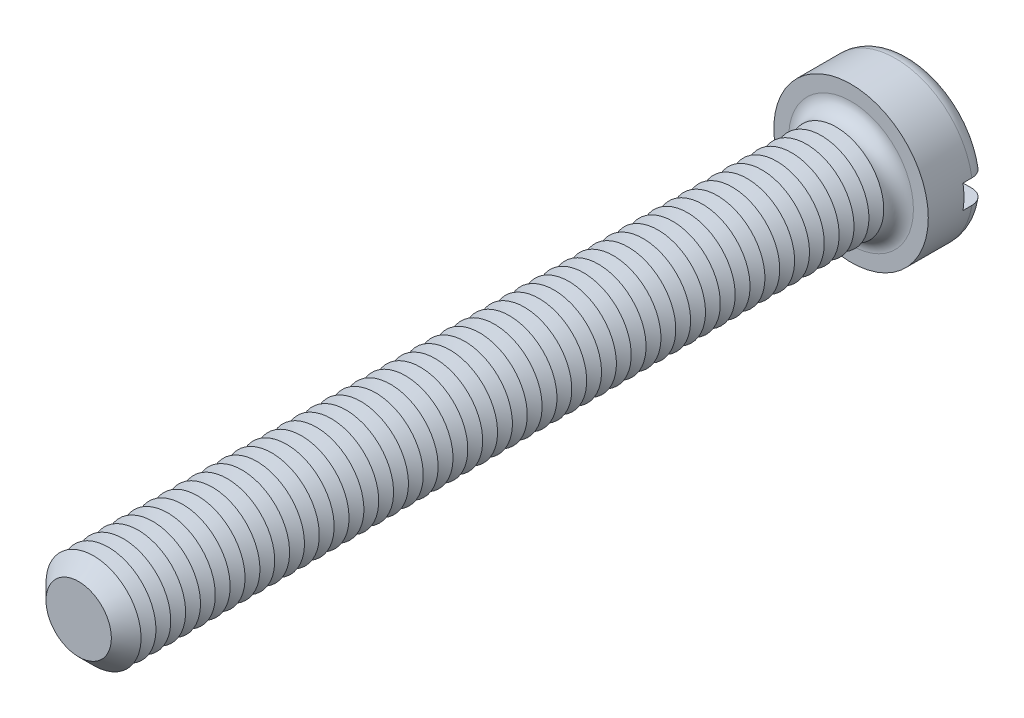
ISO-10303-21;
HEADER;
FILE_DESCRIPTION(('STEP AP214'),'2;1');
FILE_NAME('part.step','',(''),(''),'','','');
FILE_SCHEMA(('AUTOMOTIVE_DESIGN { 1 0 10303 214 1 1 1 1 }'));
ENDSEC;
DATA;
#1=APPLICATION_CONTEXT('core data for automotive mechanical design processes');
#2=APPLICATION_PROTOCOL_DEFINITION('international standard','automotive_design',2000,#1);
#3=PRODUCT_CONTEXT('',#1,'mechanical');
#4=PRODUCT('Part','Part','',(#3));
#5=PRODUCT_RELATED_PRODUCT_CATEGORY('part','',(#4));
#6=PRODUCT_DEFINITION_FORMATION('','',#4);
#7=PRODUCT_DEFINITION_CONTEXT('part definition',#1,'design');
#8=PRODUCT_DEFINITION('design','',#6,#7);
#9=PRODUCT_DEFINITION_SHAPE('','',#8);
#10=(LENGTH_UNIT() NAMED_UNIT(*) SI_UNIT(.MILLI.,.METRE.));
#11=(NAMED_UNIT(*) PLANE_ANGLE_UNIT() SI_UNIT($,.RADIAN.));
#12=(NAMED_UNIT(*) SI_UNIT($,.STERADIAN.) SOLID_ANGLE_UNIT());
#13=UNCERTAINTY_MEASURE_WITH_UNIT(LENGTH_MEASURE(1.E-05),#10,'distance_accuracy_value','');
#14=(GEOMETRIC_REPRESENTATION_CONTEXT(3) GLOBAL_UNCERTAINTY_ASSIGNED_CONTEXT((#13)) GLOBAL_UNIT_ASSIGNED_CONTEXT((#10,
#11,#12)) REPRESENTATION_CONTEXT('',''));
#15=CARTESIAN_POINT('',(0.,0.,0.));
#16=DIRECTION('',(0.,0.,1.));
#17=DIRECTION('',(1.,0.,0.));
#18=AXIS2_PLACEMENT_3D('',#15,#16,#17);
#19=CARTESIAN_POINT('',(0.,0.,-5.));
#20=DIRECTION('',(0.,0.,1.));
#21=DIRECTION('',(1.,0.,0.));
#22=AXIS2_PLACEMENT_3D('',#19,#20,#21);
#23=PLANE('',#22);
#24=CARTESIAN_POINT('',(0.,0.,-5.));
#25=DIRECTION('',(0.,0.,1.));
#26=DIRECTION('',(1.,0.,0.));
#27=AXIS2_PLACEMENT_3D('',#24,#25,#26);
#28=CIRCLE('',#27,5.25);
#29=CARTESIAN_POINT('',(-5.15388203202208,1.,-5.));
#30=VERTEX_POINT('',#29);
#31=CARTESIAN_POINT('',(5.15388203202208,1.,-5.));
#32=VERTEX_POINT('',#31);
#33=EDGE_CURVE('E116',#30,#32,#28,.F.);
#34=ORIENTED_EDGE('',*,*,#33,.T.);
#35=DIRECTION('',(1.,0.,0.));
#36=VECTOR('',#35,1.);
#37=CARTESIAN_POINT('',(-6.5,1.,-5.));
#38=LINE('',#37,#36);
#39=EDGE_CURVE('E111',#30,#32,#38,.T.);
#40=ORIENTED_EDGE('',*,*,#39,.F.);
#41=EDGE_LOOP('',(#34,#40));
#42=FACE_BOUND('',#41,.T.);
#43=ADVANCED_FACE('F39',(#42),#23,.F.);
#44=CARTESIAN_POINT('',(0.,0.,-3.75));
#45=DIRECTION('',(0.,0.,1.));
#46=DIRECTION('',(1.,0.,0.));
#47=AXIS2_PLACEMENT_3D('',#44,#45,#46);
#48=TOROIDAL_SURFACE('',#47,5.25,1.25);
#49=CARTESIAN_POINT('',(-6.04655789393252,1.,-4.63904490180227));
#50=CARTESIAN_POINT('',(-5.99546860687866,1.,-4.68885774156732));
#51=CARTESIAN_POINT('',(-5.94008472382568,1.,-4.73434760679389));
#52=CARTESIAN_POINT('',(-5.8223927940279,1.,-4.81538052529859));
#53=CARTESIAN_POINT('',(-5.7600753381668,1.,-4.85090982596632));
#54=CARTESIAN_POINT('',(-5.63044351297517,1.,-4.91100606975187));
#55=CARTESIAN_POINT('',(-5.56313479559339,1.,-4.93558519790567));
#56=CARTESIAN_POINT('',(-5.42539577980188,1.,-4.97322457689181));
#57=CARTESIAN_POINT('',(-5.35496625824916,1.,-4.98628767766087));
#58=CARTESIAN_POINT('',(-5.21212635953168,1.,-5.00070478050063));
#59=CARTESIAN_POINT('',(-5.13970265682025,1.,-5.00192674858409));
#60=CARTESIAN_POINT('',(-4.99565121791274,1.,-4.99234085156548));
#61=CARTESIAN_POINT('',(-4.92402357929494,1.,-4.98153152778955));
#62=CARTESIAN_POINT('',(-4.78274786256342,1.,-4.94801424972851));
#63=CARTESIAN_POINT('',(-4.71313137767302,1.,-4.92517296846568));
#64=CARTESIAN_POINT('',(-4.57871041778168,1.,-4.86813760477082));
#65=CARTESIAN_POINT('',(-4.51390612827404,1.,-4.83394308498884));
#66=CARTESIAN_POINT('',(-4.39095493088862,1.,-4.75508341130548));
#67=CARTESIAN_POINT('',(-4.33281197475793,1.,-4.7104120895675));
#68=CARTESIAN_POINT('',(-4.22499800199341,1.,-4.61179869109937));
#69=CARTESIAN_POINT('',(-4.17532640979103,1.,-4.55785724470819));
#70=CARTESIAN_POINT('',(-4.08677450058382,1.,-4.4431082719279));
#71=CARTESIAN_POINT('',(-4.0477350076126,1.,-4.38242369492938));
#72=CARTESIAN_POINT('',(-3.98074296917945,1.,-4.25521412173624));
#73=CARTESIAN_POINT('',(-3.95278836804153,1.,-4.18869021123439));
#74=CARTESIAN_POINT('',(-3.90959497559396,1.,-4.0537026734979));
#75=CARTESIAN_POINT('',(-3.89401985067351,1.,-3.98534663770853));
#76=CARTESIAN_POINT('',(-3.8748586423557,1.,-3.84697740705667));
#77=CARTESIAN_POINT('',(-3.87127067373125,1.,-3.7769644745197));
#78=CARTESIAN_POINT('',(-3.8761573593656,1.,-3.63892215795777));
#79=CARTESIAN_POINT('',(-3.88436651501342,1.,-3.57088319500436));
#80=CARTESIAN_POINT('',(-3.91207743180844,1.,-3.43714958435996));
#81=CARTESIAN_POINT('',(-3.93157911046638,1.,-3.37145491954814));
#82=CARTESIAN_POINT('',(-3.98125045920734,1.,-3.24411474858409));
#83=CARTESIAN_POINT('',(-4.01143761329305,1.,-3.18247607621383));
#84=CARTESIAN_POINT('',(-4.08150210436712,1.,-3.064981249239));
#85=CARTESIAN_POINT('',(-4.12138048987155,1.,-3.0091257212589));
#86=CARTESIAN_POINT('',(-4.2106718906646,1.,-2.90336353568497));
#87=CARTESIAN_POINT('',(-4.26028693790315,1.,-2.85362751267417));
#88=CARTESIAN_POINT('',(-4.36696587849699,1.,-2.76291710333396));
#89=CARTESIAN_POINT('',(-4.42403082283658,1.,-2.72194395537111));
#90=CARTESIAN_POINT('',(-4.54567957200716,1.,-2.64877280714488));
#91=CARTESIAN_POINT('',(-4.61042643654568,1.,-2.61684571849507));
#92=CARTESIAN_POINT('',(-4.74430563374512,1.,-2.56412359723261));
#93=CARTESIAN_POINT('',(-4.81343838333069,1.,-2.54332962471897));
#94=CARTESIAN_POINT('',(-4.95527237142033,1.,-2.51320471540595));
#95=CARTESIAN_POINT('',(-5.0280120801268,1.,-2.50405449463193));
#96=CARTESIAN_POINT('',(-5.17399775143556,1.,-2.49810126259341));
#97=CARTESIAN_POINT('',(-5.24724372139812,1.,-2.50129843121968));
#98=CARTESIAN_POINT('',(-5.3921014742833,1.,-2.52000776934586));
#99=CARTESIAN_POINT('',(-5.4637142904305,1.,-2.53551191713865));
#100=CARTESIAN_POINT('',(-5.60326680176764,1.,-2.57846304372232));
#101=CARTESIAN_POINT('',(-5.67120668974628,1.,-2.60590939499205));
#102=CARTESIAN_POINT('',(-5.80064060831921,1.,-2.67164926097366));
#103=CARTESIAN_POINT('',(-5.862199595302,1.,-2.7098148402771));
#104=CARTESIAN_POINT('',(-5.9779079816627,1.,-2.79608690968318));
#105=CARTESIAN_POINT('',(-6.03205795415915,1.,-2.84419263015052));
#106=CARTESIAN_POINT('',(-6.13055119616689,1.,-2.94820522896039));
#107=CARTESIAN_POINT('',(-6.17502887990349,1.,-3.00398483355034));
#108=CARTESIAN_POINT('',(-6.25384180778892,1.,-3.12230113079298));
#109=CARTESIAN_POINT('',(-6.28817779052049,1.,-3.18483733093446));
#110=CARTESIAN_POINT('',(-6.34527986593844,1.,-3.31401726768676));
#111=CARTESIAN_POINT('',(-6.36818984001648,1.,-3.38059742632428));
#112=CARTESIAN_POINT('',(-6.40240470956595,1.,-3.5166725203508));
#113=CARTESIAN_POINT('',(-6.41371067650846,1.,-3.58616718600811));
#114=CARTESIAN_POINT('',(-6.42433240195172,1.,-3.72550026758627));
#115=CARTESIAN_POINT('',(-6.4237441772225,1.,-3.79533138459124));
#116=CARTESIAN_POINT('',(-6.41082814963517,1.,-3.93391789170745));
#117=CARTESIAN_POINT('',(-6.39849757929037,1.,-4.00267302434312));
#118=CARTESIAN_POINT('',(-6.36249191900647,1.,-4.13704597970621));
#119=CARTESIAN_POINT('',(-6.33883072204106,1.,-4.20266753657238));
#120=CARTESIAN_POINT('',(-6.28088769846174,1.,-4.32897165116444));
#121=CARTESIAN_POINT('',(-6.24661890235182,1.,-4.38966015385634));
#122=CARTESIAN_POINT('',(-6.18404039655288,1.,-4.48163773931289));
#123=CARTESIAN_POINT('',(-6.15876600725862,1.,-4.51503333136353));
#124=CARTESIAN_POINT('',(-6.10500607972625,1.,-4.5791298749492));
#125=CARTESIAN_POINT('',(-6.07652056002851,1.,-4.60983084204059));
#126=CARTESIAN_POINT('',(-6.04655789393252,1.,-4.63904490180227));
#127=B_SPLINE_CURVE_WITH_KNOTS('',3,(#49,#50,#51,#52,#53,#54,#55,#56,#57,#58,#59,#60,#61,#62,
#63,#64,#65,#66,#67,#68,#69,#70,#71,#72,#73,#74,#75,#76,#77,#78,#79,#80,#81,#82,#83,#84,#85,#86,
#87,#88,#89,#90,#91,#92,#93,#94,#95,#96,#97,#98,#99,#100,#101,#102,#103,#104,#105,#106,#107,
#108,#109,#110,#111,#112,#113,#114,#115,#116,#117,#118,#119,#120,#121,#122,#123,#124,#125,#126),
.UNSPECIFIED.,.T.,.F.,(4,2,2,2,2,2,2,2,2,2,2,2,2,2,2,2,2,2,2,2,2,2,2,2,2,2,2,2,2,2,2,2,2,2,2,2,
2,2,4),(0.,0.213907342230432,0.428108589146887,0.642070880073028,0.855980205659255,
1.07227200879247,1.28859003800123,1.50735715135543,1.72613269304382,1.94503735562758,
2.16392713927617,2.37933295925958,2.59469881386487,2.80399176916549,3.01325180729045,
3.2178754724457,3.42249764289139,3.62745618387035,3.83243690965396,4.04223444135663,
4.25206160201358,4.46763253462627,4.68322399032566,4.90212226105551,5.12102372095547,
5.33978261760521,5.55853002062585,5.77477015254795,5.99099354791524,6.20398686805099,
6.41696467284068,6.62718821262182,6.83739233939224,7.0459002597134,7.25445733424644,
7.46275934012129,7.67080647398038,7.79625882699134,7.92171045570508),.UNSPECIFIED.);
#128=CARTESIAN_POINT('',(-6.42261628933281,1.,-3.74999999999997));
#129=VERTEX_POINT('',#128);
#130=EDGE_CURVE('E578',#129,#30,#127,.T.);
#131=ORIENTED_EDGE('',*,*,#130,.F.);
#132=CARTESIAN_POINT('',(0.,0.,-3.75));
#133=DIRECTION('',(0.,0.,1.));
#134=DIRECTION('',(1.,0.,0.));
#135=AXIS2_PLACEMENT_3D('',#132,#133,#134);
#136=CIRCLE('',#135,6.5);
#137=CARTESIAN_POINT('',(6.42261628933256,1.,-3.75));
#138=VERTEX_POINT('',#137);
#139=EDGE_CURVE('E124',#138,#129,#136,.T.);
#140=ORIENTED_EDGE('',*,*,#139,.F.);
#141=CARTESIAN_POINT('',(4.06944999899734,1.,-4.4133199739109));
#142=CARTESIAN_POINT('',(4.10828271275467,1.,-4.47354709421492));
#143=CARTESIAN_POINT('',(4.15233880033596,1.,-4.53047894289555));
#144=CARTESIAN_POINT('',(4.24946916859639,1.,-4.63614530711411));
#145=CARTESIAN_POINT('',(4.3025574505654,1.,-4.68486685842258));
#146=CARTESIAN_POINT('',(4.41603250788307,1.,-4.77271114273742));
#147=CARTESIAN_POINT('',(4.47640839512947,1.,-4.8118479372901));
#148=CARTESIAN_POINT('',(4.60277035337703,1.,-4.87959878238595));
#149=CARTESIAN_POINT('',(4.66875480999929,1.,-4.90821584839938));
#150=CARTESIAN_POINT('',(4.80558589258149,1.,-4.95456537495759));
#151=CARTESIAN_POINT('',(4.87649196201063,1.,-4.97212253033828));
#152=CARTESIAN_POINT('',(5.02024710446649,1.,-4.99514979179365));
#153=CARTESIAN_POINT('',(5.09309636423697,1.,-5.00061873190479));
#154=CARTESIAN_POINT('',(5.23902872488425,1.,-4.99926689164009));
#155=CARTESIAN_POINT('',(5.31211131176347,1.,-4.99238812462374));
#156=CARTESIAN_POINT('',(5.45605806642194,1.,-4.96635140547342));
#157=CARTESIAN_POINT('',(5.52692231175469,1.,-4.94719388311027));
#158=CARTESIAN_POINT('',(5.66376170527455,1.,-4.89728421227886));
#159=CARTESIAN_POINT('',(5.72977335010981,1.,-4.86663219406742));
#160=CARTESIAN_POINT('',(5.85560715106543,1.,-4.79452334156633));
#161=CARTESIAN_POINT('',(5.91542977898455,1.,-4.7530673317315));
#162=CARTESIAN_POINT('',(6.02626022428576,1.,-4.66116821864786));
#163=CARTESIAN_POINT('',(6.07738307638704,1.,-4.6108638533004));
#164=CARTESIAN_POINT('',(6.17030947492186,1.,-4.50227823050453));
#165=CARTESIAN_POINT('',(6.2121137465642,1.,-4.44399759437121));
#166=CARTESIAN_POINT('',(6.28460268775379,1.,-4.32200305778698));
#167=CARTESIAN_POINT('',(6.31543589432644,1.,-4.2583773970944));
#168=CARTESIAN_POINT('',(6.36586009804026,1.,-4.12681721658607));
#169=CARTESIAN_POINT('',(6.38545178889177,1.,-4.0588829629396));
#170=CARTESIAN_POINT('',(6.41265760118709,1.,-3.92136007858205));
#171=CARTESIAN_POINT('',(6.42038873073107,1.,-3.85179457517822));
#172=CARTESIAN_POINT('',(6.42401070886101,1.,-3.7123569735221));
#173=CARTESIAN_POINT('',(6.41990193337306,1.,-3.64248488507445));
#174=CARTESIAN_POINT('',(6.40000894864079,1.,-3.50470871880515));
#175=CARTESIAN_POINT('',(6.38427119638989,1.,-3.43679792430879));
#176=CARTESIAN_POINT('',(6.34164491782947,1.,-3.30457296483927));
#177=CARTESIAN_POINT('',(6.31475638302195,1.,-3.24025880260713));
#178=CARTESIAN_POINT('',(6.2505455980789,1.,-3.11686791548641));
#179=CARTESIAN_POINT('',(6.21319759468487,1.,-3.05780459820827));
#180=CARTESIAN_POINT('',(6.12919411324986,1.,-2.94671919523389));
#181=CARTESIAN_POINT('',(6.08253833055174,1.,-2.89469734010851));
#182=CARTESIAN_POINT('',(5.98083387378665,1.,-2.79868150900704));
#183=CARTESIAN_POINT('',(5.92571704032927,1.,-2.75475975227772));
#184=CARTESIAN_POINT('',(5.80897194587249,1.,-2.67665277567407));
#185=CARTESIAN_POINT('',(5.74734329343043,1.,-2.64246814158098));
#186=CARTESIAN_POINT('',(5.6184644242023,1.,-2.58431810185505));
#187=CARTESIAN_POINT('',(5.55115102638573,1.,-2.56049275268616));
#188=CARTESIAN_POINT('',(5.41351272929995,1.,-2.52429868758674));
#189=CARTESIAN_POINT('',(5.34318759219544,1.,-2.51193087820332));
#190=CARTESIAN_POINT('',(5.20041507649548,1.,-2.49882112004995));
#191=CARTESIAN_POINT('',(5.12795169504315,1.,-2.49825332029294));
#192=CARTESIAN_POINT('',(4.98393373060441,1.,-2.50914771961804));
#193=CARTESIAN_POINT('',(4.91237921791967,1.,-2.52061084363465));
#194=CARTESIAN_POINT('',(4.77137358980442,1.,-2.55542281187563));
#195=CARTESIAN_POINT('',(4.70195472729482,1.,-2.57890245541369));
#196=CARTESIAN_POINT('',(4.56803538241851,1.,-2.63717701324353));
#197=CARTESIAN_POINT('',(4.50353509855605,1.,-2.67197238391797));
#198=CARTESIAN_POINT('',(4.38131858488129,1.,-2.7519648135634));
#199=CARTESIAN_POINT('',(4.32360365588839,1.,-2.79716386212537));
#200=CARTESIAN_POINT('',(4.21673400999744,1.,-2.89675634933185));
#201=CARTESIAN_POINT('',(4.16757871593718,1.,-2.95114916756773));
#202=CARTESIAN_POINT('',(4.08014713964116,1.,-3.06667703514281));
#203=CARTESIAN_POINT('',(4.04170608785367,1.,-3.12768727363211));
#204=CARTESIAN_POINT('',(3.97596192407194,1.,-3.25543782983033));
#205=CARTESIAN_POINT('',(3.94865624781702,1.,-3.32217682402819));
#206=CARTESIAN_POINT('',(3.9067737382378,1.,-3.45745603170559));
#207=CARTESIAN_POINT('',(3.89185707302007,1.,-3.52589108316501));
#208=CARTESIAN_POINT('',(3.87400755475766,1.,-3.66432360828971));
#209=CARTESIAN_POINT('',(3.87107601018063,1.,-3.73432125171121));
#210=CARTESIAN_POINT('',(3.8772387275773,1.,-3.87228267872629));
#211=CARTESIAN_POINT('',(3.88607933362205,1.,-3.94025811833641));
#212=CARTESIAN_POINT('',(3.91502769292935,1.,-4.07370133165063));
#213=CARTESIAN_POINT('',(3.93512131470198,1.,-4.1391721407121));
#214=CARTESIAN_POINT('',(3.9752037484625,1.,-4.23926719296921));
#215=CARTESIAN_POINT('',(3.99171171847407,1.,-4.27532618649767));
#216=CARTESIAN_POINT('',(4.02809737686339,1.,-4.34569933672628));
#217=CARTESIAN_POINT('',(4.04797497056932,1.,-4.3800135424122));
#218=CARTESIAN_POINT('',(4.06944999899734,1.,-4.4133199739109));
#219=B_SPLINE_CURVE_WITH_KNOTS('',3,(#141,#142,#143,#144,#145,#146,#147,#148,#149,#150,#151,
#152,#153,#154,#155,#156,#157,#158,#159,#160,#161,#162,#163,#164,#165,#166,#167,#168,#169,#170,
#171,#172,#173,#174,#175,#176,#177,#178,#179,#180,#181,#182,#183,#184,#185,#186,#187,#188,#189,
#190,#191,#192,#193,#194,#195,#196,#197,#198,#199,#200,#201,#202,#203,#204,#205,#206,#207,#208,
#209,#210,#211,#212,#213,#214,#215,#216,#217,#218),.UNSPECIFIED.,.T.,.F.,(4,2,2,2,2,2,2,2,2,2,2,
2,2,2,2,2,2,2,2,2,2,2,2,2,2,2,2,2,2,2,2,2,2,2,2,2,2,2,4),(0.,0.214833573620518,
0.430003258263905,0.644855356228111,0.859645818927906,1.0777603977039,1.29589601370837,
1.51505870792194,1.73421373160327,1.95150241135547,2.16877451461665,2.38290237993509,
2.59701357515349,2.8081044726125,3.01918234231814,3.22816416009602,3.43713934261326,
3.64528416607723,3.85342914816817,4.06209119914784,4.27076008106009,4.48120788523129,
4.69166834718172,4.90489186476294,5.11813225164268,5.33451752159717,5.55091942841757,
5.76972860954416,5.98854661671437,6.20740650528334,6.42625163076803,6.64151774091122,
6.85673425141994,7.0658317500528,7.27495207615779,7.47963858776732,7.68406862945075,
7.80287790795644,7.92168384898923),.UNSPECIFIED.);
#220=EDGE_CURVE('E580',#32,#138,#219,.T.);
#221=ORIENTED_EDGE('',*,*,#220,.F.);
#222=ORIENTED_EDGE('',*,*,#33,.F.);
#223=EDGE_LOOP('',(#131,#140,#221,#222));
#224=FACE_BOUND('',#223,.T.);
#225=ADVANCED_FACE('F562',(#224),#48,.T.);
#226=CARTESIAN_POINT('',(0.,0.,-5.));
#227=DIRECTION('',(0.,0.,1.));
#228=DIRECTION('',(1.,0.,0.));
#229=AXIS2_PLACEMENT_3D('',#226,#227,#228);
#230=CYLINDRICAL_SURFACE('',#229,6.5);
#231=DIRECTION('',(0.,0.,1.));
#232=VECTOR('',#231,1.);
#233=CARTESIAN_POINT('',(6.42261628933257,1.,-5.));
#234=LINE('',#233,#232);
#235=CARTESIAN_POINT('',(6.42261628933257,1.,-3.));
#236=VERTEX_POINT('',#235);
#237=EDGE_CURVE('E596',#138,#236,#234,.T.);
#238=ORIENTED_EDGE('',*,*,#237,.F.);
#239=ORIENTED_EDGE('',*,*,#139,.T.);
#240=DIRECTION('',(0.,0.,1.));
#241=VECTOR('',#240,1.);
#242=CARTESIAN_POINT('',(-6.42261628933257,1.,-5.));
#243=LINE('',#242,#241);
#244=CARTESIAN_POINT('',(-6.42261628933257,1.,-3.));
#245=VERTEX_POINT('',#244);
#246=EDGE_CURVE('E63',#245,#129,#243,.F.);
#247=ORIENTED_EDGE('',*,*,#246,.F.);
#248=CARTESIAN_POINT('',(0.,0.,-3.));
#249=DIRECTION('',(0.,0.,-1.));
#250=DIRECTION('',(-1.,0.,0.));
#251=AXIS2_PLACEMENT_3D('',#248,#249,#250);
#252=CIRCLE('',#251,6.5);
#253=CARTESIAN_POINT('',(-6.42261628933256,-0.999999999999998,-3.));
#254=VERTEX_POINT('',#253);
#255=EDGE_CURVE('E43',#245,#254,#252,.F.);
#256=ORIENTED_EDGE('',*,*,#255,.T.);
#257=DIRECTION('',(0.,0.,1.));
#258=VECTOR('',#257,1.);
#259=CARTESIAN_POINT('',(-6.42261628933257,-0.999999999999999,-5.));
#260=LINE('',#259,#258);
#261=CARTESIAN_POINT('',(-6.42261628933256,-0.999999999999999,-3.75));
#262=VERTEX_POINT('',#261);
#263=EDGE_CURVE('E593',#262,#254,#260,.T.);
#264=ORIENTED_EDGE('',*,*,#263,.F.);
#265=CARTESIAN_POINT('',(6.42261628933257,-1.,-3.75));
#266=VERTEX_POINT('',#265);
#267=EDGE_CURVE('E126',#262,#266,#136,.T.);
#268=ORIENTED_EDGE('',*,*,#267,.T.);
#269=DIRECTION('',(0.,0.,1.));
#270=VECTOR('',#269,1.);
#271=CARTESIAN_POINT('',(6.42261628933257,-1.,-5.));
#272=LINE('',#271,#270);
#273=CARTESIAN_POINT('',(6.42261628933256,-1.,-3.));
#274=VERTEX_POINT('',#273);
#275=EDGE_CURVE('E55',#274,#266,#272,.F.);
#276=ORIENTED_EDGE('',*,*,#275,.F.);
#277=EDGE_CURVE('E11',#274,#236,#252,.F.);
#278=ORIENTED_EDGE('',*,*,#277,.T.);
#279=EDGE_LOOP('',(#238,#239,#247,#256,#264,#268,#276,#278));
#280=FACE_BOUND('',#279,.T.);
#281=CARTESIAN_POINT('',(0.,0.,0.));
#282=DIRECTION('',(0.,0.,1.));
#283=DIRECTION('',(1.,0.,0.));
#284=AXIS2_PLACEMENT_3D('',#281,#282,#283);
#285=CIRCLE('',#284,6.5);
#286=CARTESIAN_POINT('',(6.5,0.,0.));
#287=VERTEX_POINT('',#286);
#288=EDGE_CURVE('E599',#287,#287,#285,.T.);
#289=ORIENTED_EDGE('',*,*,#288,.F.);
#290=EDGE_LOOP('',(#289));
#291=FACE_BOUND('',#290,.T.);
#292=ADVANCED_FACE('F558',(#280,#291),#230,.T.);
#293=CARTESIAN_POINT('',(5.15388203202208,-1.,-5.));
#294=VERTEX_POINT('',#293);
#295=CARTESIAN_POINT('',(-5.15388203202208,-0.999999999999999,-5.));
#296=VERTEX_POINT('',#295);
#297=EDGE_CURVE('E109',#294,#296,#28,.F.);
#298=ORIENTED_EDGE('',*,*,#297,.T.);
#299=DIRECTION('',(-1.,0.,0.));
#300=VECTOR('',#299,1.);
#301=CARTESIAN_POINT('',(-6.5,-0.999999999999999,-5.));
#302=LINE('',#301,#300);
#303=EDGE_CURVE('E96',#294,#296,#302,.T.);
#304=ORIENTED_EDGE('',*,*,#303,.F.);
#305=EDGE_LOOP('',(#298,#304));
#306=FACE_BOUND('',#305,.T.);
#307=ADVANCED_FACE('F108',(#306),#23,.F.);
#308=CARTESIAN_POINT('',(0.,0.,0.));
#309=DIRECTION('',(0.,0.,1.));
#310=DIRECTION('',(1.,0.,0.));
#311=AXIS2_PLACEMENT_3D('',#308,#309,#310);
#312=PLANE('',#311);
#313=CARTESIAN_POINT('',(0.,0.,0.));
#314=DIRECTION('',(0.,0.,1.));
#315=DIRECTION('',(1.,0.,0.));
#316=AXIS2_PLACEMENT_3D('',#313,#314,#315);
#317=CIRCLE('',#316,5.25);
#318=CARTESIAN_POINT('',(5.25,0.,0.));
#319=VERTEX_POINT('',#318);
#320=EDGE_CURVE('E115',#319,#319,#317,.F.);
#321=ORIENTED_EDGE('',*,*,#320,.T.);
#322=EDGE_LOOP('',(#321));
#323=FACE_BOUND('',#322,.T.);
#324=ORIENTED_EDGE('',*,*,#288,.T.);
#325=EDGE_LOOP('',(#324));
#326=FACE_BOUND('',#325,.T.);
#327=ADVANCED_FACE('F557',(#323,#326),#312,.T.);
#328=CARTESIAN_POINT('',(-6.04655789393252,-0.999999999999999,-4.63904490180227));
#329=CARTESIAN_POINT('',(-6.0966604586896,-0.999999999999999,-4.59018532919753));
#330=CARTESIAN_POINT('',(-6.14270501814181,-0.999999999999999,-4.53709744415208));
#331=CARTESIAN_POINT('',(-6.22528519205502,-0.999999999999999,-4.42391631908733));
#332=CARTESIAN_POINT('',(-6.26181074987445,-0.999999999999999,-4.36381576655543));
#333=CARTESIAN_POINT('',(-6.32422109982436,-0.999999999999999,-4.23831836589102));
#334=CARTESIAN_POINT('',(-6.35010658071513,-0.999999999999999,-4.17292186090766));
#335=CARTESIAN_POINT('',(-6.39044668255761,-0.999999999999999,-4.03870925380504));
#336=CARTESIAN_POINT('',(-6.40490396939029,-0.999999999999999,-3.96989395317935));
#337=CARTESIAN_POINT('',(-6.42190814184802,-0.999999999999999,-3.83122595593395));
#338=CARTESIAN_POINT('',(-6.4245257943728,-0.999999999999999,-3.76138193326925));
#339=CARTESIAN_POINT('',(-6.41796432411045,-0.999999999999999,-3.62224935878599));
#340=CARTESIAN_POINT('',(-6.40878509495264,-0.999999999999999,-3.55296081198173));
#341=CARTESIAN_POINT('',(-6.37894560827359,-0.999999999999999,-3.41709241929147));
#342=CARTESIAN_POINT('',(-6.35831520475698,-0.999999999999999,-3.35050601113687));
#343=CARTESIAN_POINT('',(-6.30620980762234,-0.999999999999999,-3.22172312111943));
#344=CARTESIAN_POINT('',(-6.2747347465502,-0.999999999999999,-3.15952666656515));
#345=CARTESIAN_POINT('',(-6.20172710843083,-0.999999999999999,-3.04101762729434));
#346=CARTESIAN_POINT('',(-6.16015622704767,-0.999999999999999,-2.98472864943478));
#347=CARTESIAN_POINT('',(-6.06823774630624,-0.999999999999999,-2.87984578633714));
#348=CARTESIAN_POINT('',(-6.01788981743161,-0.999999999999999,-2.83125219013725));
#349=CARTESIAN_POINT('',(-5.90933830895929,-0.999999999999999,-2.74262118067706));
#350=CARTESIAN_POINT('',(-5.85106338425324,-0.999999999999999,-2.70267117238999));
#351=CARTESIAN_POINT('',(-5.72870702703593,-0.999999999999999,-2.63296796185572));
#352=CARTESIAN_POINT('',(-5.66462521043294,-0.999999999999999,-2.6032154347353));
#353=CARTESIAN_POINT('',(-5.53153273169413,-0.999999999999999,-2.55430842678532));
#354=CARTESIAN_POINT('',(-5.46246626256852,-0.999999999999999,-2.53530583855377));
#355=CARTESIAN_POINT('',(-5.32214267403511,-0.999999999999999,-2.5089831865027));
#356=CARTESIAN_POINT('',(-5.25088537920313,-0.999999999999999,-2.50166406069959));
#357=CARTESIAN_POINT('',(-5.10710123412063,-0.999999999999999,-2.49882202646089));
#358=CARTESIAN_POINT('',(-5.03457095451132,-0.999999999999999,-2.50347166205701));
#359=CARTESIAN_POINT('',(-4.8912897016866,-0.999999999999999,-2.52476029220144));
#360=CARTESIAN_POINT('',(-4.82053886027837,-0.999999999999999,-2.54140017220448));
#361=CARTESIAN_POINT('',(-4.68213257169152,-0.999999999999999,-2.58641614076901));
#362=CARTESIAN_POINT('',(-4.61451256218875,-0.999999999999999,-2.61490131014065));
#363=CARTESIAN_POINT('',(-4.48502801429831,-0.999999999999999,-2.68285095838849));
#364=CARTESIAN_POINT('',(-4.42316359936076,-0.999999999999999,-2.72231567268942));
#365=CARTESIAN_POINT('',(-4.30720694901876,-0.999999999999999,-2.81103994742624));
#366=CARTESIAN_POINT('',(-4.25309118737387,-0.999999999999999,-2.86026872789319));
#367=CARTESIAN_POINT('',(-4.15409408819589,-0.999999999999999,-2.9672764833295));
#368=CARTESIAN_POINT('',(-4.10921182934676,-0.999999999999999,-3.02505460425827));
#369=CARTESIAN_POINT('',(-4.03096584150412,-0.999999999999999,-3.14632492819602));
#370=CARTESIAN_POINT('',(-3.99739097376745,-0.999999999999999,-3.2096807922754));
#371=CARTESIAN_POINT('',(-3.94171839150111,-0.999999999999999,-3.34124912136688));
#372=CARTESIAN_POINT('',(-3.91961840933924,-0.999999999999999,-3.40946062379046));
#373=CARTESIAN_POINT('',(-3.88816636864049,-0.999999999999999,-3.54669256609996));
#374=CARTESIAN_POINT('',(-3.87846562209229,-0.999999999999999,-3.61563318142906));
#375=CARTESIAN_POINT('',(-3.87100568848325,-0.999999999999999,-3.75415397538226));
#376=CARTESIAN_POINT('',(-3.87324501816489,-0.999999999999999,-3.82373407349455));
#377=CARTESIAN_POINT('',(-3.88943589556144,-0.999999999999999,-3.96027701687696));
#378=CARTESIAN_POINT('',(-3.90318225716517,-0.999999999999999,-4.0272643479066));
#379=CARTESIAN_POINT('',(-3.94163954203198,-0.999999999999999,-4.1580093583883));
#380=CARTESIAN_POINT('',(-3.96635075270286,-0.999999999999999,-4.22176695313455));
#381=CARTESIAN_POINT('',(-4.026160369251,-0.999999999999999,-4.34483320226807));
#382=CARTESIAN_POINT('',(-4.06134035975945,-0.999999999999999,-4.40410214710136));
#383=CARTESIAN_POINT('',(-4.14090865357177,-0.999999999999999,-4.51609417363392));
#384=CARTESIAN_POINT('',(-4.18529811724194,-0.999999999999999,-4.56881642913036));
#385=CARTESIAN_POINT('',(-4.2832649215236,-0.999999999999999,-4.66770177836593));
#386=CARTESIAN_POINT('',(-4.33705327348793,-0.999999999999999,-4.71365579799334));
#387=CARTESIAN_POINT('',(-4.45141776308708,-0.999999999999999,-4.79615385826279));
#388=CARTESIAN_POINT('',(-4.51199483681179,-0.999999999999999,-4.83269659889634));
#389=CARTESIAN_POINT('',(-4.63989216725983,-0.999999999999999,-4.89626962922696));
#390=CARTESIAN_POINT('',(-4.70734508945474,-0.999999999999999,-4.92303326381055));
#391=CARTESIAN_POINT('',(-4.84575497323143,-0.999999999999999,-4.96500199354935));
#392=CARTESIAN_POINT('',(-4.91671207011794,-0.999999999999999,-4.98020664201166));
#393=CARTESIAN_POINT('',(-5.06097761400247,-0.999999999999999,-4.9987306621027));
#394=CARTESIAN_POINT('',(-5.13430353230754,-0.999999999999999,-5.00191441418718));
#395=CARTESIAN_POINT('',(-5.28046546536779,-0.999999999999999,-4.99587686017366));
#396=CARTESIAN_POINT('',(-5.35330135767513,-0.999999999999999,-4.98665256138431));
#397=CARTESIAN_POINT('',(-5.49610354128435,-0.999999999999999,-4.95604184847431));
#398=CARTESIAN_POINT('',(-5.56607890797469,-0.999999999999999,-4.93469772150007));
#399=CARTESIAN_POINT('',(-5.70131538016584,-0.999999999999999,-4.88041956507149));
#400=CARTESIAN_POINT('',(-5.76658233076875,-0.999999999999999,-4.84750021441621));
#401=CARTESIAN_POINT('',(-5.86782577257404,-0.999999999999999,-4.78498748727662));
#402=CARTESIAN_POINT('',(-5.90579749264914,-0.999999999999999,-4.75856648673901));
#403=CARTESIAN_POINT('',(-5.97862186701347,-0.999999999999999,-4.70172646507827));
#404=CARTESIAN_POINT('',(-6.0134745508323,-0.999999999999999,-4.6713074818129));
#405=CARTESIAN_POINT('',(-6.04655789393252,-0.999999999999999,-4.63904490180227));
#406=B_SPLINE_CURVE_WITH_KNOTS('',3,(#328,#329,#330,#331,#332,#333,#334,#335,#336,#337,#338,
#339,#340,#341,#342,#343,#344,#345,#346,#347,#348,#349,#350,#351,#352,#353,#354,#355,#356,#357,
#358,#359,#360,#361,#362,#363,#364,#365,#366,#367,#368,#369,#370,#371,#372,#373,#374,#375,#376,
#377,#378,#379,#380,#381,#382,#383,#384,#385,#386,#387,#388,#389,#390,#391,#392,#393,#394,#395,
#396,#397,#398,#399,#400,#401,#402,#403,#404,#405),.UNSPECIFIED.,.T.,.F.,(4,2,2,2,2,2,2,2,2,2,2,
2,2,2,2,2,2,2,2,2,2,2,2,2,2,2,2,2,2,2,2,2,2,2,2,2,2,2,4),(0.,0.209780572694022,
0.419781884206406,0.629769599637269,0.839708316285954,1.04839053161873,1.2570746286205,
1.46521720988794,1.67336108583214,1.88230736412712,2.09126148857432,2.30223890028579,
2.51323027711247,2.72713284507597,2.94105258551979,3.15807345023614,3.37511034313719,
3.59419176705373,3.81327788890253,4.03168404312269,4.25006839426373,4.46411376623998,
4.67811682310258,4.88595885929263,5.09377507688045,5.29796268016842,5.50215563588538,
5.70798353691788,5.91383738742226,6.12510741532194,6.33640661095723,6.55309998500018,
6.76980173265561,6.98894112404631,7.20813337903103,7.42656551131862,7.64472163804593,
7.78324365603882,7.92176436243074),.UNSPECIFIED.);
#407=EDGE_CURVE('E103',#296,#262,#406,.T.);
#408=ORIENTED_EDGE('',*,*,#407,.F.);
#409=ORIENTED_EDGE('',*,*,#297,.F.);
#410=CARTESIAN_POINT('',(4.06944999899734,-1.,-4.4133199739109));
#411=CARTESIAN_POINT('',(4.03213207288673,-1.,-4.3554312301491));
#412=CARTESIAN_POINT('',(3.9995849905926,-1.,-4.29441722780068));
#413=CARTESIAN_POINT('',(3.94511822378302,-1.,-4.16776604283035));
#414=CARTESIAN_POINT('',(3.92320762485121,-1.,-4.10212496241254));
#415=CARTESIAN_POINT('',(3.89078811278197,-1.,-3.96804412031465));
#416=CARTESIAN_POINT('',(3.88028409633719,-1.,-3.89960316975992));
#417=CARTESIAN_POINT('',(3.87107895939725,-1.,-3.76194650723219));
#418=CARTESIAN_POINT('',(3.87237511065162,-1.,-3.69273097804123));
#419=CARTESIAN_POINT('',(3.88662927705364,-1.,-3.55634460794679));
#420=CARTESIAN_POINT('',(3.89944923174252,-1.,-3.48915926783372));
#421=CARTESIAN_POINT('',(3.93611188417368,-1.,-3.35786953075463));
#422=CARTESIAN_POINT('',(3.95995518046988,-1.,-3.29376530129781));
#423=CARTESIAN_POINT('',(4.0180748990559,-1.,-3.16993562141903));
#424=CARTESIAN_POINT('',(4.05242297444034,-1.,-3.11024385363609));
#425=CARTESIAN_POINT('',(4.13041121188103,-1.,-2.9972793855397));
#426=CARTESIAN_POINT('',(4.17405248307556,-1.,-2.94400745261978));
#427=CARTESIAN_POINT('',(4.27058636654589,-1.,-2.8439150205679));
#428=CARTESIAN_POINT('',(4.32368948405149,-1.,-2.79729757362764));
#429=CARTESIAN_POINT('',(4.43679856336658,-1.,-2.71336600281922));
#430=CARTESIAN_POINT('',(4.49680546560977,-1.,-2.67605314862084));
#431=CARTESIAN_POINT('',(4.62370121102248,-1.,-2.61081752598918));
#432=CARTESIAN_POINT('',(4.69072799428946,-1.,-2.58316284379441));
#433=CARTESIAN_POINT('',(4.82843981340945,-1.,-2.5393441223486));
#434=CARTESIAN_POINT('',(4.899125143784,-1.,-2.52318100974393));
#435=CARTESIAN_POINT('',(5.04306377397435,-1.,-2.50267755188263));
#436=CARTESIAN_POINT('',(5.11633773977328,-1.,-2.49848181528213));
#437=CARTESIAN_POINT('',(5.26254809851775,-1.,-2.50249357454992));
#438=CARTESIAN_POINT('',(5.33548449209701,-1.,-2.51070104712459));
#439=CARTESIAN_POINT('',(5.4786703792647,-1.,-2.53930888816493));
#440=CARTESIAN_POINT('',(5.54892819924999,-1.,-2.5596675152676));
#441=CARTESIAN_POINT('',(5.68495799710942,-1.,-2.61204238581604));
#442=CARTESIAN_POINT('',(5.75073024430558,-1.,-2.64405792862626));
#443=CARTESIAN_POINT('',(5.8750178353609,-1.,-2.7184150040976));
#444=CARTESIAN_POINT('',(5.93361487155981,-1.,-2.76061995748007));
#445=CARTESIAN_POINT('',(6.04275377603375,-1.,-2.85440601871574));
#446=CARTESIAN_POINT('',(6.09329629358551,-1.,-2.90598637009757));
#447=CARTESIAN_POINT('',(6.18409572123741,-1.,-3.01622977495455));
#448=CARTESIAN_POINT('',(6.2244945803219,-1.,-3.07477592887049));
#449=CARTESIAN_POINT('',(6.29474798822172,-1.,-3.19788594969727));
#450=CARTESIAN_POINT('',(6.3246032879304,-1.,-3.26244938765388));
#451=CARTESIAN_POINT('',(6.37256001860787,-1.,-3.39491634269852));
#452=CARTESIAN_POINT('',(6.39079949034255,-1.,-3.46276990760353));
#453=CARTESIAN_POINT('',(6.41554133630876,-1.,-3.60058363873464));
#454=CARTESIAN_POINT('',(6.42204424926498,-1.,-3.67054370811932));
#455=CARTESIAN_POINT('',(6.42311237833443,-1.,-3.81007982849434));
#456=CARTESIAN_POINT('',(6.41775799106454,-1.,-3.879655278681));
#457=CARTESIAN_POINT('',(6.39543799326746,-1.,-4.01691664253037));
#458=CARTESIAN_POINT('',(6.3784725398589,-1.,-4.08460258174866));
#459=CARTESIAN_POINT('',(6.33344768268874,-1.,-4.21614537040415));
#460=CARTESIAN_POINT('',(6.30539273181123,-1.,-4.28000374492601));
#461=CARTESIAN_POINT('',(6.23902076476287,-1.,-4.40214140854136));
#462=CARTESIAN_POINT('',(6.20070356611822,-1.,-4.46042059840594));
#463=CARTESIAN_POINT('',(6.11467174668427,-1.,-4.5701315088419));
#464=CARTESIAN_POINT('',(6.06690270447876,-1.,-4.62152053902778));
#465=CARTESIAN_POINT('',(5.96350111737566,-1.,-4.715657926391));
#466=CARTESIAN_POINT('',(5.90786817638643,-1.,-4.75840584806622));
#467=CARTESIAN_POINT('',(5.78965380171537,-1.,-4.8345781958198));
#468=CARTESIAN_POINT('',(5.72700078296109,-1.,-4.86789149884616));
#469=CARTESIAN_POINT('',(5.59704977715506,-1.,-4.92369754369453));
#470=CARTESIAN_POINT('',(5.52975144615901,-1.,-4.94618948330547));
#471=CARTESIAN_POINT('',(5.39137621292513,-1.,-4.98006173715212));
#472=CARTESIAN_POINT('',(5.32025859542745,-1.,-4.99127571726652));
#473=CARTESIAN_POINT('',(5.17715081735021,-1.,-5.00177798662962));
#474=CARTESIAN_POINT('',(5.10516061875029,-1.,-5.00106575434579));
#475=CARTESIAN_POINT('',(4.96131924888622,-1.,-4.98769775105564));
#476=CARTESIAN_POINT('',(4.88948297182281,-1.,-4.97488146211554));
#477=CARTESIAN_POINT('',(4.74893184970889,-1.,-4.93744335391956));
#478=CARTESIAN_POINT('',(4.68021795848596,-1.,-4.91281795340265));
#479=CARTESIAN_POINT('',(4.54744428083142,-1.,-4.8522329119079));
#480=CARTESIAN_POINT('',(4.48341761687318,-1.,-4.81620070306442));
#481=CARTESIAN_POINT('',(4.36244497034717,-1.,-4.73383277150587));
#482=CARTESIAN_POINT('',(4.30549069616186,-1.,-4.68750929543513));
#483=CARTESIAN_POINT('',(4.21823158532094,-1.,-4.60311228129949));
#484=CARTESIAN_POINT('',(4.18544074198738,-1.,-4.56757118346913));
#485=CARTESIAN_POINT('',(4.12413461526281,-1.,-4.49297229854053));
#486=CARTESIAN_POINT('',(4.09561926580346,-1.,-4.45391456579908));
#487=CARTESIAN_POINT('',(4.06944999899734,-1.,-4.4133199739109));
#488=B_SPLINE_CURVE_WITH_KNOTS('',3,(#410,#411,#412,#413,#414,#415,#416,#417,#418,#419,#420,
#421,#422,#423,#424,#425,#426,#427,#428,#429,#430,#431,#432,#433,#434,#435,#436,#437,#438,#439,
#440,#441,#442,#443,#444,#445,#446,#447,#448,#449,#450,#451,#452,#453,#454,#455,#456,#457,#458,
#459,#460,#461,#462,#463,#464,#465,#466,#467,#468,#469,#470,#471,#472,#473,#474,#475,#476,#477,
#478,#479,#480,#481,#482,#483,#484,#485,#486,#487),.UNSPECIFIED.,.T.,.F.,(4,2,2,2,2,2,2,2,2,2,2,
2,2,2,2,2,2,2,2,2,2,2,2,2,2,2,2,2,2,2,2,2,2,2,2,2,2,2,4),(0.,0.206453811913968,0.4130836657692,
0.619802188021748,0.826472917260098,1.03070015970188,1.23493849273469,1.44060223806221,
1.64629054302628,1.85731119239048,2.06836062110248,2.28487349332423,2.5014038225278,
2.72053974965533,2.9396752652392,3.15806230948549,3.37643622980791,3.59203140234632,
3.80760918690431,4.01997696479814,4.23232961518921,4.44210913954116,4.65187903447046,
4.86023097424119,5.06858009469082,5.27684563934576,5.48511488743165,5.69462015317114,
5.90413597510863,6.11602561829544,6.32793096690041,6.54291770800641,6.75791385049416,
6.97580180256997,7.19375587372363,7.41312537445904,7.63223520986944,7.77701357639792,
7.92178970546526),.UNSPECIFIED.);
#489=EDGE_CURVE('E92',#266,#294,#488,.T.);
#490=ORIENTED_EDGE('',*,*,#489,.F.);
#491=ORIENTED_EDGE('',*,*,#267,.F.);
#492=EDGE_LOOP('',(#408,#409,#490,#491));
#493=FACE_BOUND('',#492,.T.);
#494=ADVANCED_FACE('F113',(#493),#48,.T.);
#495=CARTESIAN_POINT('',(0.,0.,1.25));
#496=DIRECTION('',(0.,0.,1.));
#497=DIRECTION('',(1.,0.,0.));
#498=AXIS2_PLACEMENT_3D('',#495,#496,#497);
#499=TOROIDAL_SURFACE('',#498,5.25,1.25);
#500=ORIENTED_EDGE('',*,*,#320,.F.);
#501=EDGE_LOOP('',(#500));
#502=FACE_BOUND('',#501,.T.);
#503=CARTESIAN_POINT('',(0.,0.,1.25));
#504=DIRECTION('',(0.,0.,-1.));
#505=DIRECTION('',(-1.,0.,0.));
#506=AXIS2_PLACEMENT_3D('',#503,#504,#505);
#507=CIRCLE('',#506,4.);
#508=CARTESIAN_POINT('',(-4.,0.,1.25));
#509=VERTEX_POINT('',#508);
#510=EDGE_CURVE('E605',#509,#509,#507,.T.);
#511=ORIENTED_EDGE('',*,*,#510,.T.);
#512=EDGE_LOOP('',(#511));
#513=FACE_BOUND('',#512,.T.);
#514=ADVANCED_FACE('F550',(#502,#513),#499,.F.);
#515=CARTESIAN_POINT('',(0.,0.,1.875));
#516=DIRECTION('',(0.,0.,-1.));
#517=DIRECTION('',(-1.,0.,0.));
#518=AXIS2_PLACEMENT_3D('',#515,#516,#517);
#519=CONICAL_SURFACE('',#518,2.91746824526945,1.0471975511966);
#520=ORIENTED_EDGE('',*,*,#510,.F.);
#521=EDGE_LOOP('',(#520));
#522=FACE_BOUND('',#521,.T.);
#523=CARTESIAN_POINT('',(0.,0.,1.875));
#524=DIRECTION('',(0.,0.,-1.));
#525=DIRECTION('',(-1.,0.,0.));
#526=AXIS2_PLACEMENT_3D('',#523,#524,#525);
#527=CIRCLE('',#526,2.91746824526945);
#528=CARTESIAN_POINT('',(-2.91746824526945,0.,1.875));
#529=VERTEX_POINT('',#528);
#530=EDGE_CURVE('E612',#529,#529,#527,.T.);
#531=ORIENTED_EDGE('',*,*,#530,.T.);
#532=EDGE_LOOP('',(#531));
#533=FACE_BOUND('',#532,.T.);
#534=ADVANCED_FACE('F546',(#522,#533),#519,.T.);
#535=CARTESIAN_POINT('',(0.,0.,2.5));
#536=DIRECTION('',(0.,0.,1.));
#537=DIRECTION('',(1.,0.,0.));
#538=AXIS2_PLACEMENT_3D('',#535,#536,#537);
#539=CONICAL_SURFACE('',#538,4.,1.0471975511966);
#540=ORIENTED_EDGE('',*,*,#530,.F.);
#541=EDGE_LOOP('',(#540));
#542=FACE_BOUND('',#541,.T.);
#543=CARTESIAN_POINT('',(0.,0.,2.5));
#544=DIRECTION('',(0.,0.,-1.));
#545=DIRECTION('',(-1.,0.,0.));
#546=AXIS2_PLACEMENT_3D('',#543,#544,#545);
#547=CIRCLE('',#546,4.);
#548=CARTESIAN_POINT('',(-4.,0.,2.5));
#549=VERTEX_POINT('',#548);
#550=EDGE_CURVE('E618',#549,#549,#547,.T.);
#551=ORIENTED_EDGE('',*,*,#550,.T.);
#552=EDGE_LOOP('',(#551));
#553=FACE_BOUND('',#552,.T.);
#554=ADVANCED_FACE('F542',(#542,#553),#539,.T.);
#555=CARTESIAN_POINT('',(0.,0.,3.125));
#556=DIRECTION('',(0.,0.,-1.));
#557=DIRECTION('',(-1.,0.,0.));
#558=AXIS2_PLACEMENT_3D('',#555,#556,#557);
#559=CONICAL_SURFACE('',#558,2.91746824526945,1.0471975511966);
#560=ORIENTED_EDGE('',*,*,#550,.F.);
#561=EDGE_LOOP('',(#560));
#562=FACE_BOUND('',#561,.T.);
#563=CARTESIAN_POINT('',(0.,0.,3.125));
#564=DIRECTION('',(0.,0.,-1.));
#565=DIRECTION('',(-1.,0.,0.));
#566=AXIS2_PLACEMENT_3D('',#563,#564,#565);
#567=CIRCLE('',#566,2.91746824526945);
#568=CARTESIAN_POINT('',(-2.91746824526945,0.,3.125));
#569=VERTEX_POINT('',#568);
#570=EDGE_CURVE('E621',#569,#569,#567,.T.);
#571=ORIENTED_EDGE('',*,*,#570,.T.);
#572=EDGE_LOOP('',(#571));
#573=FACE_BOUND('',#572,.T.);
#574=ADVANCED_FACE('F538',(#562,#573),#559,.T.);
#575=CARTESIAN_POINT('',(0.,0.,3.75));
#576=DIRECTION('',(0.,0.,1.));
#577=DIRECTION('',(1.,0.,0.));
#578=AXIS2_PLACEMENT_3D('',#575,#576,#577);
#579=CONICAL_SURFACE('',#578,4.,1.0471975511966);
#580=ORIENTED_EDGE('',*,*,#570,.F.);
#581=EDGE_LOOP('',(#580));
#582=FACE_BOUND('',#581,.T.);
#583=CARTESIAN_POINT('',(0.,0.,3.75));
#584=DIRECTION('',(0.,0.,-1.));
#585=DIRECTION('',(-1.,0.,0.));
#586=AXIS2_PLACEMENT_3D('',#583,#584,#585);
#587=CIRCLE('',#586,4.);
#588=CARTESIAN_POINT('',(-4.,0.,3.75));
#589=VERTEX_POINT('',#588);
#590=EDGE_CURVE('E625',#589,#589,#587,.T.);
#591=ORIENTED_EDGE('',*,*,#590,.T.);
#592=EDGE_LOOP('',(#591));
#593=FACE_BOUND('',#592,.T.);
#594=ADVANCED_FACE('F534',(#582,#593),#579,.T.);
#595=CARTESIAN_POINT('',(0.,0.,4.375));
#596=DIRECTION('',(0.,0.,-1.));
#597=DIRECTION('',(-1.,0.,0.));
#598=AXIS2_PLACEMENT_3D('',#595,#596,#597);
#599=CONICAL_SURFACE('',#598,2.91746824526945,1.0471975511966);
#600=ORIENTED_EDGE('',*,*,#590,.F.);
#601=EDGE_LOOP('',(#600));
#602=FACE_BOUND('',#601,.T.);
#603=CARTESIAN_POINT('',(0.,0.,4.375));
#604=DIRECTION('',(0.,0.,-1.));
#605=DIRECTION('',(-1.,0.,0.));
#606=AXIS2_PLACEMENT_3D('',#603,#604,#605);
#607=CIRCLE('',#606,2.91746824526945);
#608=CARTESIAN_POINT('',(-2.91746824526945,0.,4.375));
#609=VERTEX_POINT('',#608);
#610=EDGE_CURVE('E628',#609,#609,#607,.T.);
#611=ORIENTED_EDGE('',*,*,#610,.T.);
#612=EDGE_LOOP('',(#611));
#613=FACE_BOUND('',#612,.T.);
#614=ADVANCED_FACE('F530',(#602,#613),#599,.T.);
#615=CARTESIAN_POINT('',(0.,0.,5.));
#616=DIRECTION('',(0.,0.,1.));
#617=DIRECTION('',(1.,0.,0.));
#618=AXIS2_PLACEMENT_3D('',#615,#616,#617);
#619=CONICAL_SURFACE('',#618,4.,1.0471975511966);
#620=ORIENTED_EDGE('',*,*,#610,.F.);
#621=EDGE_LOOP('',(#620));
#622=FACE_BOUND('',#621,.T.);
#623=CARTESIAN_POINT('',(0.,0.,5.));
#624=DIRECTION('',(0.,0.,-1.));
#625=DIRECTION('',(-1.,0.,0.));
#626=AXIS2_PLACEMENT_3D('',#623,#624,#625);
#627=CIRCLE('',#626,4.);
#628=CARTESIAN_POINT('',(-4.,0.,5.));
#629=VERTEX_POINT('',#628);
#630=EDGE_CURVE('E631',#629,#629,#627,.T.);
#631=ORIENTED_EDGE('',*,*,#630,.T.);
#632=EDGE_LOOP('',(#631));
#633=FACE_BOUND('',#632,.T.);
#634=ADVANCED_FACE('F526',(#622,#633),#619,.T.);
#635=CARTESIAN_POINT('',(0.,0.,5.625));
#636=DIRECTION('',(0.,0.,-1.));
#637=DIRECTION('',(-1.,0.,0.));
#638=AXIS2_PLACEMENT_3D('',#635,#636,#637);
#639=CONICAL_SURFACE('',#638,2.91746824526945,1.0471975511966);
#640=ORIENTED_EDGE('',*,*,#630,.F.);
#641=EDGE_LOOP('',(#640));
#642=FACE_BOUND('',#641,.T.);
#643=CARTESIAN_POINT('',(0.,0.,5.625));
#644=DIRECTION('',(0.,0.,-1.));
#645=DIRECTION('',(-1.,0.,0.));
#646=AXIS2_PLACEMENT_3D('',#643,#644,#645);
#647=CIRCLE('',#646,2.91746824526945);
#648=CARTESIAN_POINT('',(-2.91746824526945,0.,5.625));
#649=VERTEX_POINT('',#648);
#650=EDGE_CURVE('E635',#649,#649,#647,.T.);
#651=ORIENTED_EDGE('',*,*,#650,.T.);
#652=EDGE_LOOP('',(#651));
#653=FACE_BOUND('',#652,.T.);
#654=ADVANCED_FACE('F522',(#642,#653),#639,.T.);
#655=CARTESIAN_POINT('',(0.,0.,6.25));
#656=DIRECTION('',(0.,0.,1.));
#657=DIRECTION('',(1.,0.,0.));
#658=AXIS2_PLACEMENT_3D('',#655,#656,#657);
#659=CONICAL_SURFACE('',#658,4.,1.0471975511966);
#660=ORIENTED_EDGE('',*,*,#650,.F.);
#661=EDGE_LOOP('',(#660));
#662=FACE_BOUND('',#661,.T.);
#663=CARTESIAN_POINT('',(0.,0.,6.25));
#664=DIRECTION('',(0.,0.,-1.));
#665=DIRECTION('',(-1.,0.,0.));
#666=AXIS2_PLACEMENT_3D('',#663,#664,#665);
#667=CIRCLE('',#666,4.);
#668=CARTESIAN_POINT('',(-4.,0.,6.25));
#669=VERTEX_POINT('',#668);
#670=EDGE_CURVE('E639',#669,#669,#667,.T.);
#671=ORIENTED_EDGE('',*,*,#670,.T.);
#672=EDGE_LOOP('',(#671));
#673=FACE_BOUND('',#672,.T.);
#674=ADVANCED_FACE('F518',(#662,#673),#659,.T.);
#675=CARTESIAN_POINT('',(0.,0.,6.875));
#676=DIRECTION('',(0.,0.,-1.));
#677=DIRECTION('',(-1.,0.,0.));
#678=AXIS2_PLACEMENT_3D('',#675,#676,#677);
#679=CONICAL_SURFACE('',#678,2.91746824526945,1.0471975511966);
#680=ORIENTED_EDGE('',*,*,#670,.F.);
#681=EDGE_LOOP('',(#680));
#682=FACE_BOUND('',#681,.T.);
#683=CARTESIAN_POINT('',(0.,0.,6.875));
#684=DIRECTION('',(0.,0.,-1.));
#685=DIRECTION('',(-1.,0.,0.));
#686=AXIS2_PLACEMENT_3D('',#683,#684,#685);
#687=CIRCLE('',#686,2.91746824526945);
#688=CARTESIAN_POINT('',(-2.91746824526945,0.,6.875));
#689=VERTEX_POINT('',#688);
#690=EDGE_CURVE('E643',#689,#689,#687,.T.);
#691=ORIENTED_EDGE('',*,*,#690,.T.);
#692=EDGE_LOOP('',(#691));
#693=FACE_BOUND('',#692,.T.);
#694=ADVANCED_FACE('F514',(#682,#693),#679,.T.);
#695=CARTESIAN_POINT('',(0.,0.,7.5));
#696=DIRECTION('',(0.,0.,1.));
#697=DIRECTION('',(1.,0.,0.));
#698=AXIS2_PLACEMENT_3D('',#695,#696,#697);
#699=CONICAL_SURFACE('',#698,4.,1.0471975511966);
#700=ORIENTED_EDGE('',*,*,#690,.F.);
#701=EDGE_LOOP('',(#700));
#702=FACE_BOUND('',#701,.T.);
#703=CARTESIAN_POINT('',(0.,0.,7.5));
#704=DIRECTION('',(0.,0.,-1.));
#705=DIRECTION('',(-1.,0.,0.));
#706=AXIS2_PLACEMENT_3D('',#703,#704,#705);
#707=CIRCLE('',#706,4.);
#708=CARTESIAN_POINT('',(-4.,0.,7.5));
#709=VERTEX_POINT('',#708);
#710=EDGE_CURVE('E647',#709,#709,#707,.T.);
#711=ORIENTED_EDGE('',*,*,#710,.T.);
#712=EDGE_LOOP('',(#711));
#713=FACE_BOUND('',#712,.T.);
#714=ADVANCED_FACE('F510',(#702,#713),#699,.T.);
#715=CARTESIAN_POINT('',(0.,0.,8.125));
#716=DIRECTION('',(0.,0.,-1.));
#717=DIRECTION('',(-1.,0.,0.));
#718=AXIS2_PLACEMENT_3D('',#715,#716,#717);
#719=CONICAL_SURFACE('',#718,2.91746824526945,1.0471975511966);
#720=ORIENTED_EDGE('',*,*,#710,.F.);
#721=EDGE_LOOP('',(#720));
#722=FACE_BOUND('',#721,.T.);
#723=CARTESIAN_POINT('',(0.,0.,8.125));
#724=DIRECTION('',(0.,0.,-1.));
#725=DIRECTION('',(-1.,0.,0.));
#726=AXIS2_PLACEMENT_3D('',#723,#724,#725);
#727=CIRCLE('',#726,2.91746824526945);
#728=CARTESIAN_POINT('',(-2.91746824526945,0.,8.125));
#729=VERTEX_POINT('',#728);
#730=EDGE_CURVE('E651',#729,#729,#727,.T.);
#731=ORIENTED_EDGE('',*,*,#730,.T.);
#732=EDGE_LOOP('',(#731));
#733=FACE_BOUND('',#732,.T.);
#734=ADVANCED_FACE('F506',(#722,#733),#719,.T.);
#735=CARTESIAN_POINT('',(0.,0.,8.75));
#736=DIRECTION('',(0.,0.,1.));
#737=DIRECTION('',(1.,0.,0.));
#738=AXIS2_PLACEMENT_3D('',#735,#736,#737);
#739=CONICAL_SURFACE('',#738,4.,1.0471975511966);
#740=ORIENTED_EDGE('',*,*,#730,.F.);
#741=EDGE_LOOP('',(#740));
#742=FACE_BOUND('',#741,.T.);
#743=CARTESIAN_POINT('',(0.,0.,8.75));
#744=DIRECTION('',(0.,0.,-1.));
#745=DIRECTION('',(-1.,0.,0.));
#746=AXIS2_PLACEMENT_3D('',#743,#744,#745);
#747=CIRCLE('',#746,4.);
#748=CARTESIAN_POINT('',(-4.,0.,8.75));
#749=VERTEX_POINT('',#748);
#750=EDGE_CURVE('E655',#749,#749,#747,.T.);
#751=ORIENTED_EDGE('',*,*,#750,.T.);
#752=EDGE_LOOP('',(#751));
#753=FACE_BOUND('',#752,.T.);
#754=ADVANCED_FACE('F502',(#742,#753),#739,.T.);
#755=CARTESIAN_POINT('',(0.,0.,9.375));
#756=DIRECTION('',(0.,0.,-1.));
#757=DIRECTION('',(-1.,0.,0.));
#758=AXIS2_PLACEMENT_3D('',#755,#756,#757);
#759=CONICAL_SURFACE('',#758,2.91746824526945,1.0471975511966);
#760=ORIENTED_EDGE('',*,*,#750,.F.);
#761=EDGE_LOOP('',(#760));
#762=FACE_BOUND('',#761,.T.);
#763=CARTESIAN_POINT('',(0.,0.,9.375));
#764=DIRECTION('',(0.,0.,-1.));
#765=DIRECTION('',(-1.,0.,0.));
#766=AXIS2_PLACEMENT_3D('',#763,#764,#765);
#767=CIRCLE('',#766,2.91746824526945);
#768=CARTESIAN_POINT('',(-2.91746824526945,0.,9.375));
#769=VERTEX_POINT('',#768);
#770=EDGE_CURVE('E658',#769,#769,#767,.T.);
#771=ORIENTED_EDGE('',*,*,#770,.T.);
#772=EDGE_LOOP('',(#771));
#773=FACE_BOUND('',#772,.T.);
#774=ADVANCED_FACE('F498',(#762,#773),#759,.T.);
#775=CARTESIAN_POINT('',(0.,0.,10.));
#776=DIRECTION('',(0.,0.,1.));
#777=DIRECTION('',(1.,0.,0.));
#778=AXIS2_PLACEMENT_3D('',#775,#776,#777);
#779=CONICAL_SURFACE('',#778,4.,1.0471975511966);
#780=ORIENTED_EDGE('',*,*,#770,.F.);
#781=EDGE_LOOP('',(#780));
#782=FACE_BOUND('',#781,.T.);
#783=CARTESIAN_POINT('',(0.,0.,10.));
#784=DIRECTION('',(0.,0.,-1.));
#785=DIRECTION('',(-1.,0.,0.));
#786=AXIS2_PLACEMENT_3D('',#783,#784,#785);
#787=CIRCLE('',#786,4.);
#788=CARTESIAN_POINT('',(-4.,0.,10.));
#789=VERTEX_POINT('',#788);
#790=EDGE_CURVE('E662',#789,#789,#787,.T.);
#791=ORIENTED_EDGE('',*,*,#790,.T.);
#792=EDGE_LOOP('',(#791));
#793=FACE_BOUND('',#792,.T.);
#794=ADVANCED_FACE('F494',(#782,#793),#779,.T.);
#795=CARTESIAN_POINT('',(0.,0.,10.625));
#796=DIRECTION('',(0.,0.,-1.));
#797=DIRECTION('',(-1.,0.,0.));
#798=AXIS2_PLACEMENT_3D('',#795,#796,#797);
#799=CONICAL_SURFACE('',#798,2.91746824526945,1.0471975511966);
#800=ORIENTED_EDGE('',*,*,#790,.F.);
#801=EDGE_LOOP('',(#800));
#802=FACE_BOUND('',#801,.T.);
#803=CARTESIAN_POINT('',(0.,0.,10.625));
#804=DIRECTION('',(0.,0.,-1.));
#805=DIRECTION('',(-1.,0.,0.));
#806=AXIS2_PLACEMENT_3D('',#803,#804,#805);
#807=CIRCLE('',#806,2.91746824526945);
#808=CARTESIAN_POINT('',(-2.91746824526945,0.,10.625));
#809=VERTEX_POINT('',#808);
#810=EDGE_CURVE('E666',#809,#809,#807,.T.);
#811=ORIENTED_EDGE('',*,*,#810,.T.);
#812=EDGE_LOOP('',(#811));
#813=FACE_BOUND('',#812,.T.);
#814=ADVANCED_FACE('F490',(#802,#813),#799,.T.);
#815=CARTESIAN_POINT('',(0.,0.,11.25));
#816=DIRECTION('',(0.,0.,1.));
#817=DIRECTION('',(1.,0.,0.));
#818=AXIS2_PLACEMENT_3D('',#815,#816,#817);
#819=CONICAL_SURFACE('',#818,4.,1.0471975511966);
#820=ORIENTED_EDGE('',*,*,#810,.F.);
#821=EDGE_LOOP('',(#820));
#822=FACE_BOUND('',#821,.T.);
#823=CARTESIAN_POINT('',(0.,0.,11.25));
#824=DIRECTION('',(0.,0.,-1.));
#825=DIRECTION('',(-1.,0.,0.));
#826=AXIS2_PLACEMENT_3D('',#823,#824,#825);
#827=CIRCLE('',#826,4.);
#828=CARTESIAN_POINT('',(-4.,0.,11.25));
#829=VERTEX_POINT('',#828);
#830=EDGE_CURVE('E670',#829,#829,#827,.T.);
#831=ORIENTED_EDGE('',*,*,#830,.T.);
#832=EDGE_LOOP('',(#831));
#833=FACE_BOUND('',#832,.T.);
#834=ADVANCED_FACE('F486',(#822,#833),#819,.T.);
#835=CARTESIAN_POINT('',(0.,0.,11.875));
#836=DIRECTION('',(0.,0.,-1.));
#837=DIRECTION('',(-1.,0.,0.));
#838=AXIS2_PLACEMENT_3D('',#835,#836,#837);
#839=CONICAL_SURFACE('',#838,2.91746824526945,1.0471975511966);
#840=ORIENTED_EDGE('',*,*,#830,.F.);
#841=EDGE_LOOP('',(#840));
#842=FACE_BOUND('',#841,.T.);
#843=CARTESIAN_POINT('',(0.,0.,11.875));
#844=DIRECTION('',(0.,0.,-1.));
#845=DIRECTION('',(-1.,0.,0.));
#846=AXIS2_PLACEMENT_3D('',#843,#844,#845);
#847=CIRCLE('',#846,2.91746824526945);
#848=CARTESIAN_POINT('',(-2.91746824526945,0.,11.875));
#849=VERTEX_POINT('',#848);
#850=EDGE_CURVE('E674',#849,#849,#847,.T.);
#851=ORIENTED_EDGE('',*,*,#850,.T.);
#852=EDGE_LOOP('',(#851));
#853=FACE_BOUND('',#852,.T.);
#854=ADVANCED_FACE('F482',(#842,#853),#839,.T.);
#855=CARTESIAN_POINT('',(0.,0.,12.5));
#856=DIRECTION('',(0.,0.,1.));
#857=DIRECTION('',(1.,0.,0.));
#858=AXIS2_PLACEMENT_3D('',#855,#856,#857);
#859=CONICAL_SURFACE('',#858,4.,1.0471975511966);
#860=ORIENTED_EDGE('',*,*,#850,.F.);
#861=EDGE_LOOP('',(#860));
#862=FACE_BOUND('',#861,.T.);
#863=CARTESIAN_POINT('',(0.,0.,12.5));
#864=DIRECTION('',(0.,0.,-1.));
#865=DIRECTION('',(-1.,0.,0.));
#866=AXIS2_PLACEMENT_3D('',#863,#864,#865);
#867=CIRCLE('',#866,4.);
#868=CARTESIAN_POINT('',(-4.,0.,12.5));
#869=VERTEX_POINT('',#868);
#870=EDGE_CURVE('E678',#869,#869,#867,.T.);
#871=ORIENTED_EDGE('',*,*,#870,.T.);
#872=EDGE_LOOP('',(#871));
#873=FACE_BOUND('',#872,.T.);
#874=ADVANCED_FACE('F478',(#862,#873),#859,.T.);
#875=CARTESIAN_POINT('',(0.,0.,13.125));
#876=DIRECTION('',(0.,0.,-1.));
#877=DIRECTION('',(-1.,0.,0.));
#878=AXIS2_PLACEMENT_3D('',#875,#876,#877);
#879=CONICAL_SURFACE('',#878,2.91746824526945,1.0471975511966);
#880=ORIENTED_EDGE('',*,*,#870,.F.);
#881=EDGE_LOOP('',(#880));
#882=FACE_BOUND('',#881,.T.);
#883=CARTESIAN_POINT('',(0.,0.,13.125));
#884=DIRECTION('',(0.,0.,-1.));
#885=DIRECTION('',(-1.,0.,0.));
#886=AXIS2_PLACEMENT_3D('',#883,#884,#885);
#887=CIRCLE('',#886,2.91746824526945);
#888=CARTESIAN_POINT('',(-2.91746824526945,0.,13.125));
#889=VERTEX_POINT('',#888);
#890=EDGE_CURVE('E682',#889,#889,#887,.T.);
#891=ORIENTED_EDGE('',*,*,#890,.T.);
#892=EDGE_LOOP('',(#891));
#893=FACE_BOUND('',#892,.T.);
#894=ADVANCED_FACE('F474',(#882,#893),#879,.T.);
#895=CARTESIAN_POINT('',(0.,0.,13.75));
#896=DIRECTION('',(0.,0.,1.));
#897=DIRECTION('',(1.,0.,0.));
#898=AXIS2_PLACEMENT_3D('',#895,#896,#897);
#899=CONICAL_SURFACE('',#898,4.,1.0471975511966);
#900=ORIENTED_EDGE('',*,*,#890,.F.);
#901=EDGE_LOOP('',(#900));
#902=FACE_BOUND('',#901,.T.);
#903=CARTESIAN_POINT('',(0.,0.,13.75));
#904=DIRECTION('',(0.,0.,-1.));
#905=DIRECTION('',(-1.,0.,0.));
#906=AXIS2_PLACEMENT_3D('',#903,#904,#905);
#907=CIRCLE('',#906,4.);
#908=CARTESIAN_POINT('',(-4.,0.,13.75));
#909=VERTEX_POINT('',#908);
#910=EDGE_CURVE('E686',#909,#909,#907,.T.);
#911=ORIENTED_EDGE('',*,*,#910,.T.);
#912=EDGE_LOOP('',(#911));
#913=FACE_BOUND('',#912,.T.);
#914=ADVANCED_FACE('F470',(#902,#913),#899,.T.);
#915=CARTESIAN_POINT('',(0.,0.,14.375));
#916=DIRECTION('',(0.,0.,-1.));
#917=DIRECTION('',(-1.,0.,0.));
#918=AXIS2_PLACEMENT_3D('',#915,#916,#917);
#919=CONICAL_SURFACE('',#918,2.91746824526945,1.0471975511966);
#920=ORIENTED_EDGE('',*,*,#910,.F.);
#921=EDGE_LOOP('',(#920));
#922=FACE_BOUND('',#921,.T.);
#923=CARTESIAN_POINT('',(0.,0.,14.375));
#924=DIRECTION('',(0.,0.,-1.));
#925=DIRECTION('',(-1.,0.,0.));
#926=AXIS2_PLACEMENT_3D('',#923,#924,#925);
#927=CIRCLE('',#926,2.91746824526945);
#928=CARTESIAN_POINT('',(-2.91746824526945,0.,14.375));
#929=VERTEX_POINT('',#928);
#930=EDGE_CURVE('E690',#929,#929,#927,.T.);
#931=ORIENTED_EDGE('',*,*,#930,.T.);
#932=EDGE_LOOP('',(#931));
#933=FACE_BOUND('',#932,.T.);
#934=ADVANCED_FACE('F466',(#922,#933),#919,.T.);
#935=CARTESIAN_POINT('',(0.,0.,15.));
#936=DIRECTION('',(0.,0.,1.));
#937=DIRECTION('',(1.,0.,0.));
#938=AXIS2_PLACEMENT_3D('',#935,#936,#937);
#939=CONICAL_SURFACE('',#938,4.,1.0471975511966);
#940=ORIENTED_EDGE('',*,*,#930,.F.);
#941=EDGE_LOOP('',(#940));
#942=FACE_BOUND('',#941,.T.);
#943=CARTESIAN_POINT('',(0.,0.,15.));
#944=DIRECTION('',(0.,0.,-1.));
#945=DIRECTION('',(-1.,0.,0.));
#946=AXIS2_PLACEMENT_3D('',#943,#944,#945);
#947=CIRCLE('',#946,4.);
#948=CARTESIAN_POINT('',(-4.,0.,15.));
#949=VERTEX_POINT('',#948);
#950=EDGE_CURVE('E693',#949,#949,#947,.T.);
#951=ORIENTED_EDGE('',*,*,#950,.T.);
#952=EDGE_LOOP('',(#951));
#953=FACE_BOUND('',#952,.T.);
#954=ADVANCED_FACE('F462',(#942,#953),#939,.T.);
#955=CARTESIAN_POINT('',(0.,0.,15.625));
#956=DIRECTION('',(0.,0.,-1.));
#957=DIRECTION('',(-1.,0.,0.));
#958=AXIS2_PLACEMENT_3D('',#955,#956,#957);
#959=CONICAL_SURFACE('',#958,2.91746824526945,1.0471975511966);
#960=ORIENTED_EDGE('',*,*,#950,.F.);
#961=EDGE_LOOP('',(#960));
#962=FACE_BOUND('',#961,.T.);
#963=CARTESIAN_POINT('',(0.,0.,15.625));
#964=DIRECTION('',(0.,0.,-1.));
#965=DIRECTION('',(-1.,0.,0.));
#966=AXIS2_PLACEMENT_3D('',#963,#964,#965);
#967=CIRCLE('',#966,2.91746824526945);
#968=CARTESIAN_POINT('',(-2.91746824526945,0.,15.625));
#969=VERTEX_POINT('',#968);
#970=EDGE_CURVE('E697',#969,#969,#967,.T.);
#971=ORIENTED_EDGE('',*,*,#970,.T.);
#972=EDGE_LOOP('',(#971));
#973=FACE_BOUND('',#972,.T.);
#974=ADVANCED_FACE('F458',(#962,#973),#959,.T.);
#975=CARTESIAN_POINT('',(0.,0.,16.25));
#976=DIRECTION('',(0.,0.,1.));
#977=DIRECTION('',(1.,0.,0.));
#978=AXIS2_PLACEMENT_3D('',#975,#976,#977);
#979=CONICAL_SURFACE('',#978,4.,1.0471975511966);
#980=ORIENTED_EDGE('',*,*,#970,.F.);
#981=EDGE_LOOP('',(#980));
#982=FACE_BOUND('',#981,.T.);
#983=CARTESIAN_POINT('',(0.,0.,16.25));
#984=DIRECTION('',(0.,0.,-1.));
#985=DIRECTION('',(-1.,0.,0.));
#986=AXIS2_PLACEMENT_3D('',#983,#984,#985);
#987=CIRCLE('',#986,4.);
#988=CARTESIAN_POINT('',(-4.,0.,16.25));
#989=VERTEX_POINT('',#988);
#990=EDGE_CURVE('E701',#989,#989,#987,.T.);
#991=ORIENTED_EDGE('',*,*,#990,.T.);
#992=EDGE_LOOP('',(#991));
#993=FACE_BOUND('',#992,.T.);
#994=ADVANCED_FACE('F454',(#982,#993),#979,.T.);
#995=CARTESIAN_POINT('',(0.,0.,16.875));
#996=DIRECTION('',(0.,0.,-1.));
#997=DIRECTION('',(-1.,0.,0.));
#998=AXIS2_PLACEMENT_3D('',#995,#996,#997);
#999=CONICAL_SURFACE('',#998,2.91746824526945,1.0471975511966);
#1000=ORIENTED_EDGE('',*,*,#990,.F.);
#1001=EDGE_LOOP('',(#1000));
#1002=FACE_BOUND('',#1001,.T.);
#1003=CARTESIAN_POINT('',(0.,0.,16.875));
#1004=DIRECTION('',(0.,0.,-1.));
#1005=DIRECTION('',(-1.,0.,0.));
#1006=AXIS2_PLACEMENT_3D('',#1003,#1004,#1005);
#1007=CIRCLE('',#1006,2.91746824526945);
#1008=CARTESIAN_POINT('',(-2.91746824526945,0.,16.875));
#1009=VERTEX_POINT('',#1008);
#1010=EDGE_CURVE('E705',#1009,#1009,#1007,.T.);
#1011=ORIENTED_EDGE('',*,*,#1010,.T.);
#1012=EDGE_LOOP('',(#1011));
#1013=FACE_BOUND('',#1012,.T.);
#1014=ADVANCED_FACE('F450',(#1002,#1013),#999,.T.);
#1015=CARTESIAN_POINT('',(0.,0.,17.5));
#1016=DIRECTION('',(0.,0.,1.));
#1017=DIRECTION('',(1.,0.,0.));
#1018=AXIS2_PLACEMENT_3D('',#1015,#1016,#1017);
#1019=CONICAL_SURFACE('',#1018,4.,1.0471975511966);
#1020=ORIENTED_EDGE('',*,*,#1010,.F.);
#1021=EDGE_LOOP('',(#1020));
#1022=FACE_BOUND('',#1021,.T.);
#1023=CARTESIAN_POINT('',(0.,0.,17.5));
#1024=DIRECTION('',(0.,0.,-1.));
#1025=DIRECTION('',(-1.,0.,0.));
#1026=AXIS2_PLACEMENT_3D('',#1023,#1024,#1025);
#1027=CIRCLE('',#1026,4.);
#1028=CARTESIAN_POINT('',(-4.,0.,17.5));
#1029=VERTEX_POINT('',#1028);
#1030=EDGE_CURVE('E709',#1029,#1029,#1027,.T.);
#1031=ORIENTED_EDGE('',*,*,#1030,.T.);
#1032=EDGE_LOOP('',(#1031));
#1033=FACE_BOUND('',#1032,.T.);
#1034=ADVANCED_FACE('F446',(#1022,#1033),#1019,.T.);
#1035=CARTESIAN_POINT('',(0.,0.,18.125));
#1036=DIRECTION('',(0.,0.,-1.));
#1037=DIRECTION('',(-1.,0.,0.));
#1038=AXIS2_PLACEMENT_3D('',#1035,#1036,#1037);
#1039=CONICAL_SURFACE('',#1038,2.91746824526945,1.0471975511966);
#1040=ORIENTED_EDGE('',*,*,#1030,.F.);
#1041=EDGE_LOOP('',(#1040));
#1042=FACE_BOUND('',#1041,.T.);
#1043=CARTESIAN_POINT('',(0.,0.,18.125));
#1044=DIRECTION('',(0.,0.,-1.));
#1045=DIRECTION('',(-1.,0.,0.));
#1046=AXIS2_PLACEMENT_3D('',#1043,#1044,#1045);
#1047=CIRCLE('',#1046,2.91746824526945);
#1048=CARTESIAN_POINT('',(-2.91746824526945,0.,18.125));
#1049=VERTEX_POINT('',#1048);
#1050=EDGE_CURVE('E713',#1049,#1049,#1047,.T.);
#1051=ORIENTED_EDGE('',*,*,#1050,.T.);
#1052=EDGE_LOOP('',(#1051));
#1053=FACE_BOUND('',#1052,.T.);
#1054=ADVANCED_FACE('F442',(#1042,#1053),#1039,.T.);
#1055=CARTESIAN_POINT('',(0.,0.,18.75));
#1056=DIRECTION('',(0.,0.,1.));
#1057=DIRECTION('',(1.,0.,0.));
#1058=AXIS2_PLACEMENT_3D('',#1055,#1056,#1057);
#1059=CONICAL_SURFACE('',#1058,4.,1.0471975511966);
#1060=ORIENTED_EDGE('',*,*,#1050,.F.);
#1061=EDGE_LOOP('',(#1060));
#1062=FACE_BOUND('',#1061,.T.);
#1063=CARTESIAN_POINT('',(0.,0.,18.75));
#1064=DIRECTION('',(0.,0.,-1.));
#1065=DIRECTION('',(-1.,0.,0.));
#1066=AXIS2_PLACEMENT_3D('',#1063,#1064,#1065);
#1067=CIRCLE('',#1066,4.);
#1068=CARTESIAN_POINT('',(-4.,0.,18.75));
#1069=VERTEX_POINT('',#1068);
#1070=EDGE_CURVE('E717',#1069,#1069,#1067,.T.);
#1071=ORIENTED_EDGE('',*,*,#1070,.T.);
#1072=EDGE_LOOP('',(#1071));
#1073=FACE_BOUND('',#1072,.T.);
#1074=ADVANCED_FACE('F438',(#1062,#1073),#1059,.T.);
#1075=CARTESIAN_POINT('',(0.,0.,19.375));
#1076=DIRECTION('',(0.,0.,-1.));
#1077=DIRECTION('',(-1.,0.,0.));
#1078=AXIS2_PLACEMENT_3D('',#1075,#1076,#1077);
#1079=CONICAL_SURFACE('',#1078,2.91746824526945,1.0471975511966);
#1080=ORIENTED_EDGE('',*,*,#1070,.F.);
#1081=EDGE_LOOP('',(#1080));
#1082=FACE_BOUND('',#1081,.T.);
#1083=CARTESIAN_POINT('',(0.,0.,19.375));
#1084=DIRECTION('',(0.,0.,-1.));
#1085=DIRECTION('',(-1.,0.,0.));
#1086=AXIS2_PLACEMENT_3D('',#1083,#1084,#1085);
#1087=CIRCLE('',#1086,2.91746824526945);
#1088=CARTESIAN_POINT('',(-2.91746824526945,0.,19.375));
#1089=VERTEX_POINT('',#1088);
#1090=EDGE_CURVE('E721',#1089,#1089,#1087,.T.);
#1091=ORIENTED_EDGE('',*,*,#1090,.T.);
#1092=EDGE_LOOP('',(#1091));
#1093=FACE_BOUND('',#1092,.T.);
#1094=ADVANCED_FACE('F434',(#1082,#1093),#1079,.T.);
#1095=CARTESIAN_POINT('',(0.,0.,20.));
#1096=DIRECTION('',(0.,0.,1.));
#1097=DIRECTION('',(1.,0.,0.));
#1098=AXIS2_PLACEMENT_3D('',#1095,#1096,#1097);
#1099=CONICAL_SURFACE('',#1098,4.,1.0471975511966);
#1100=ORIENTED_EDGE('',*,*,#1090,.F.);
#1101=EDGE_LOOP('',(#1100));
#1102=FACE_BOUND('',#1101,.T.);
#1103=CARTESIAN_POINT('',(0.,0.,20.));
#1104=DIRECTION('',(0.,0.,-1.));
#1105=DIRECTION('',(-1.,0.,0.));
#1106=AXIS2_PLACEMENT_3D('',#1103,#1104,#1105);
#1107=CIRCLE('',#1106,4.);
#1108=CARTESIAN_POINT('',(-4.,0.,20.));
#1109=VERTEX_POINT('',#1108);
#1110=EDGE_CURVE('E725',#1109,#1109,#1107,.T.);
#1111=ORIENTED_EDGE('',*,*,#1110,.T.);
#1112=EDGE_LOOP('',(#1111));
#1113=FACE_BOUND('',#1112,.T.);
#1114=ADVANCED_FACE('F430',(#1102,#1113),#1099,.T.);
#1115=CARTESIAN_POINT('',(0.,0.,20.625));
#1116=DIRECTION('',(0.,0.,-1.));
#1117=DIRECTION('',(-1.,0.,0.));
#1118=AXIS2_PLACEMENT_3D('',#1115,#1116,#1117);
#1119=CONICAL_SURFACE('',#1118,2.91746824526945,1.0471975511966);
#1120=ORIENTED_EDGE('',*,*,#1110,.F.);
#1121=EDGE_LOOP('',(#1120));
#1122=FACE_BOUND('',#1121,.T.);
#1123=CARTESIAN_POINT('',(0.,0.,20.625));
#1124=DIRECTION('',(0.,0.,-1.));
#1125=DIRECTION('',(-1.,0.,0.));
#1126=AXIS2_PLACEMENT_3D('',#1123,#1124,#1125);
#1127=CIRCLE('',#1126,2.91746824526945);
#1128=CARTESIAN_POINT('',(-2.91746824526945,0.,20.625));
#1129=VERTEX_POINT('',#1128);
#1130=EDGE_CURVE('E729',#1129,#1129,#1127,.T.);
#1131=ORIENTED_EDGE('',*,*,#1130,.T.);
#1132=EDGE_LOOP('',(#1131));
#1133=FACE_BOUND('',#1132,.T.);
#1134=ADVANCED_FACE('F426',(#1122,#1133),#1119,.T.);
#1135=CARTESIAN_POINT('',(0.,0.,21.25));
#1136=DIRECTION('',(0.,0.,1.));
#1137=DIRECTION('',(1.,0.,0.));
#1138=AXIS2_PLACEMENT_3D('',#1135,#1136,#1137);
#1139=CONICAL_SURFACE('',#1138,4.,1.0471975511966);
#1140=ORIENTED_EDGE('',*,*,#1130,.F.);
#1141=EDGE_LOOP('',(#1140));
#1142=FACE_BOUND('',#1141,.T.);
#1143=CARTESIAN_POINT('',(0.,0.,21.25));
#1144=DIRECTION('',(0.,0.,-1.));
#1145=DIRECTION('',(-1.,0.,0.));
#1146=AXIS2_PLACEMENT_3D('',#1143,#1144,#1145);
#1147=CIRCLE('',#1146,4.);
#1148=CARTESIAN_POINT('',(-4.,0.,21.25));
#1149=VERTEX_POINT('',#1148);
#1150=EDGE_CURVE('E733',#1149,#1149,#1147,.T.);
#1151=ORIENTED_EDGE('',*,*,#1150,.T.);
#1152=EDGE_LOOP('',(#1151));
#1153=FACE_BOUND('',#1152,.T.);
#1154=ADVANCED_FACE('F422',(#1142,#1153),#1139,.T.);
#1155=CARTESIAN_POINT('',(0.,0.,21.875));
#1156=DIRECTION('',(0.,0.,-1.));
#1157=DIRECTION('',(-1.,0.,0.));
#1158=AXIS2_PLACEMENT_3D('',#1155,#1156,#1157);
#1159=CONICAL_SURFACE('',#1158,2.91746824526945,1.0471975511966);
#1160=ORIENTED_EDGE('',*,*,#1150,.F.);
#1161=EDGE_LOOP('',(#1160));
#1162=FACE_BOUND('',#1161,.T.);
#1163=CARTESIAN_POINT('',(0.,0.,21.875));
#1164=DIRECTION('',(0.,0.,-1.));
#1165=DIRECTION('',(-1.,0.,0.));
#1166=AXIS2_PLACEMENT_3D('',#1163,#1164,#1165);
#1167=CIRCLE('',#1166,2.91746824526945);
#1168=CARTESIAN_POINT('',(-2.91746824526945,0.,21.875));
#1169=VERTEX_POINT('',#1168);
#1170=EDGE_CURVE('E737',#1169,#1169,#1167,.T.);
#1171=ORIENTED_EDGE('',*,*,#1170,.T.);
#1172=EDGE_LOOP('',(#1171));
#1173=FACE_BOUND('',#1172,.T.);
#1174=ADVANCED_FACE('F418',(#1162,#1173),#1159,.T.);
#1175=CARTESIAN_POINT('',(0.,0.,22.5));
#1176=DIRECTION('',(0.,0.,1.));
#1177=DIRECTION('',(1.,0.,0.));
#1178=AXIS2_PLACEMENT_3D('',#1175,#1176,#1177);
#1179=CONICAL_SURFACE('',#1178,4.,1.0471975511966);
#1180=ORIENTED_EDGE('',*,*,#1170,.F.);
#1181=EDGE_LOOP('',(#1180));
#1182=FACE_BOUND('',#1181,.T.);
#1183=CARTESIAN_POINT('',(0.,0.,22.5));
#1184=DIRECTION('',(0.,0.,-1.));
#1185=DIRECTION('',(-1.,0.,0.));
#1186=AXIS2_PLACEMENT_3D('',#1183,#1184,#1185);
#1187=CIRCLE('',#1186,4.);
#1188=CARTESIAN_POINT('',(-4.,0.,22.5));
#1189=VERTEX_POINT('',#1188);
#1190=EDGE_CURVE('E741',#1189,#1189,#1187,.T.);
#1191=ORIENTED_EDGE('',*,*,#1190,.T.);
#1192=EDGE_LOOP('',(#1191));
#1193=FACE_BOUND('',#1192,.T.);
#1194=ADVANCED_FACE('F414',(#1182,#1193),#1179,.T.);
#1195=CARTESIAN_POINT('',(0.,0.,23.125));
#1196=DIRECTION('',(0.,0.,-1.));
#1197=DIRECTION('',(-1.,0.,0.));
#1198=AXIS2_PLACEMENT_3D('',#1195,#1196,#1197);
#1199=CONICAL_SURFACE('',#1198,2.91746824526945,1.0471975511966);
#1200=ORIENTED_EDGE('',*,*,#1190,.F.);
#1201=EDGE_LOOP('',(#1200));
#1202=FACE_BOUND('',#1201,.T.);
#1203=CARTESIAN_POINT('',(0.,0.,23.125));
#1204=DIRECTION('',(0.,0.,-1.));
#1205=DIRECTION('',(-1.,0.,0.));
#1206=AXIS2_PLACEMENT_3D('',#1203,#1204,#1205);
#1207=CIRCLE('',#1206,2.91746824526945);
#1208=CARTESIAN_POINT('',(-2.91746824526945,0.,23.125));
#1209=VERTEX_POINT('',#1208);
#1210=EDGE_CURVE('E745',#1209,#1209,#1207,.T.);
#1211=ORIENTED_EDGE('',*,*,#1210,.T.);
#1212=EDGE_LOOP('',(#1211));
#1213=FACE_BOUND('',#1212,.T.);
#1214=ADVANCED_FACE('F410',(#1202,#1213),#1199,.T.);
#1215=CARTESIAN_POINT('',(0.,0.,23.75));
#1216=DIRECTION('',(0.,0.,1.));
#1217=DIRECTION('',(1.,0.,0.));
#1218=AXIS2_PLACEMENT_3D('',#1215,#1216,#1217);
#1219=CONICAL_SURFACE('',#1218,4.,1.0471975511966);
#1220=ORIENTED_EDGE('',*,*,#1210,.F.);
#1221=EDGE_LOOP('',(#1220));
#1222=FACE_BOUND('',#1221,.T.);
#1223=CARTESIAN_POINT('',(0.,0.,23.75));
#1224=DIRECTION('',(0.,0.,-1.));
#1225=DIRECTION('',(-1.,0.,0.));
#1226=AXIS2_PLACEMENT_3D('',#1223,#1224,#1225);
#1227=CIRCLE('',#1226,4.);
#1228=CARTESIAN_POINT('',(-4.,0.,23.75));
#1229=VERTEX_POINT('',#1228);
#1230=EDGE_CURVE('E749',#1229,#1229,#1227,.T.);
#1231=ORIENTED_EDGE('',*,*,#1230,.T.);
#1232=EDGE_LOOP('',(#1231));
#1233=FACE_BOUND('',#1232,.T.);
#1234=ADVANCED_FACE('F406',(#1222,#1233),#1219,.T.);
#1235=CARTESIAN_POINT('',(0.,0.,24.375));
#1236=DIRECTION('',(0.,0.,-1.));
#1237=DIRECTION('',(-1.,0.,0.));
#1238=AXIS2_PLACEMENT_3D('',#1235,#1236,#1237);
#1239=CONICAL_SURFACE('',#1238,2.91746824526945,1.0471975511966);
#1240=ORIENTED_EDGE('',*,*,#1230,.F.);
#1241=EDGE_LOOP('',(#1240));
#1242=FACE_BOUND('',#1241,.T.);
#1243=CARTESIAN_POINT('',(0.,0.,24.375));
#1244=DIRECTION('',(0.,0.,-1.));
#1245=DIRECTION('',(-1.,0.,0.));
#1246=AXIS2_PLACEMENT_3D('',#1243,#1244,#1245);
#1247=CIRCLE('',#1246,2.91746824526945);
#1248=CARTESIAN_POINT('',(-2.91746824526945,0.,24.375));
#1249=VERTEX_POINT('',#1248);
#1250=EDGE_CURVE('E753',#1249,#1249,#1247,.T.);
#1251=ORIENTED_EDGE('',*,*,#1250,.T.);
#1252=EDGE_LOOP('',(#1251));
#1253=FACE_BOUND('',#1252,.T.);
#1254=ADVANCED_FACE('F402',(#1242,#1253),#1239,.T.);
#1255=CARTESIAN_POINT('',(0.,0.,25.));
#1256=DIRECTION('',(0.,0.,1.));
#1257=DIRECTION('',(1.,0.,0.));
#1258=AXIS2_PLACEMENT_3D('',#1255,#1256,#1257);
#1259=CONICAL_SURFACE('',#1258,4.,1.0471975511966);
#1260=ORIENTED_EDGE('',*,*,#1250,.F.);
#1261=EDGE_LOOP('',(#1260));
#1262=FACE_BOUND('',#1261,.T.);
#1263=CARTESIAN_POINT('',(0.,0.,25.));
#1264=DIRECTION('',(0.,0.,-1.));
#1265=DIRECTION('',(-1.,0.,0.));
#1266=AXIS2_PLACEMENT_3D('',#1263,#1264,#1265);
#1267=CIRCLE('',#1266,4.);
#1268=CARTESIAN_POINT('',(-4.,0.,25.));
#1269=VERTEX_POINT('',#1268);
#1270=EDGE_CURVE('E757',#1269,#1269,#1267,.T.);
#1271=ORIENTED_EDGE('',*,*,#1270,.T.);
#1272=EDGE_LOOP('',(#1271));
#1273=FACE_BOUND('',#1272,.T.);
#1274=ADVANCED_FACE('F398',(#1262,#1273),#1259,.T.);
#1275=CARTESIAN_POINT('',(0.,0.,25.625));
#1276=DIRECTION('',(0.,0.,-1.));
#1277=DIRECTION('',(-1.,0.,0.));
#1278=AXIS2_PLACEMENT_3D('',#1275,#1276,#1277);
#1279=CONICAL_SURFACE('',#1278,2.91746824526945,1.0471975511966);
#1280=ORIENTED_EDGE('',*,*,#1270,.F.);
#1281=EDGE_LOOP('',(#1280));
#1282=FACE_BOUND('',#1281,.T.);
#1283=CARTESIAN_POINT('',(0.,0.,25.625));
#1284=DIRECTION('',(0.,0.,-1.));
#1285=DIRECTION('',(-1.,0.,0.));
#1286=AXIS2_PLACEMENT_3D('',#1283,#1284,#1285);
#1287=CIRCLE('',#1286,2.91746824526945);
#1288=CARTESIAN_POINT('',(-2.91746824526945,0.,25.625));
#1289=VERTEX_POINT('',#1288);
#1290=EDGE_CURVE('E761',#1289,#1289,#1287,.T.);
#1291=ORIENTED_EDGE('',*,*,#1290,.T.);
#1292=EDGE_LOOP('',(#1291));
#1293=FACE_BOUND('',#1292,.T.);
#1294=ADVANCED_FACE('F394',(#1282,#1293),#1279,.T.);
#1295=CARTESIAN_POINT('',(0.,0.,26.25));
#1296=DIRECTION('',(0.,0.,1.));
#1297=DIRECTION('',(1.,0.,0.));
#1298=AXIS2_PLACEMENT_3D('',#1295,#1296,#1297);
#1299=CONICAL_SURFACE('',#1298,4.,1.0471975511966);
#1300=ORIENTED_EDGE('',*,*,#1290,.F.);
#1301=EDGE_LOOP('',(#1300));
#1302=FACE_BOUND('',#1301,.T.);
#1303=CARTESIAN_POINT('',(0.,0.,26.25));
#1304=DIRECTION('',(0.,0.,-1.));
#1305=DIRECTION('',(-1.,0.,0.));
#1306=AXIS2_PLACEMENT_3D('',#1303,#1304,#1305);
#1307=CIRCLE('',#1306,4.);
#1308=CARTESIAN_POINT('',(-4.,0.,26.25));
#1309=VERTEX_POINT('',#1308);
#1310=EDGE_CURVE('E765',#1309,#1309,#1307,.T.);
#1311=ORIENTED_EDGE('',*,*,#1310,.T.);
#1312=EDGE_LOOP('',(#1311));
#1313=FACE_BOUND('',#1312,.T.);
#1314=ADVANCED_FACE('F390',(#1302,#1313),#1299,.T.);
#1315=CARTESIAN_POINT('',(0.,0.,26.875));
#1316=DIRECTION('',(0.,0.,-1.));
#1317=DIRECTION('',(-1.,0.,0.));
#1318=AXIS2_PLACEMENT_3D('',#1315,#1316,#1317);
#1319=CONICAL_SURFACE('',#1318,2.91746824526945,1.0471975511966);
#1320=ORIENTED_EDGE('',*,*,#1310,.F.);
#1321=EDGE_LOOP('',(#1320));
#1322=FACE_BOUND('',#1321,.T.);
#1323=CARTESIAN_POINT('',(0.,0.,26.875));
#1324=DIRECTION('',(0.,0.,-1.));
#1325=DIRECTION('',(-1.,0.,0.));
#1326=AXIS2_PLACEMENT_3D('',#1323,#1324,#1325);
#1327=CIRCLE('',#1326,2.91746824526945);
#1328=CARTESIAN_POINT('',(-2.91746824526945,0.,26.875));
#1329=VERTEX_POINT('',#1328);
#1330=EDGE_CURVE('E769',#1329,#1329,#1327,.T.);
#1331=ORIENTED_EDGE('',*,*,#1330,.T.);
#1332=EDGE_LOOP('',(#1331));
#1333=FACE_BOUND('',#1332,.T.);
#1334=ADVANCED_FACE('F386',(#1322,#1333),#1319,.T.);
#1335=CARTESIAN_POINT('',(0.,0.,27.5));
#1336=DIRECTION('',(0.,0.,1.));
#1337=DIRECTION('',(1.,0.,0.));
#1338=AXIS2_PLACEMENT_3D('',#1335,#1336,#1337);
#1339=CONICAL_SURFACE('',#1338,4.,1.0471975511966);
#1340=ORIENTED_EDGE('',*,*,#1330,.F.);
#1341=EDGE_LOOP('',(#1340));
#1342=FACE_BOUND('',#1341,.T.);
#1343=CARTESIAN_POINT('',(0.,0.,27.5));
#1344=DIRECTION('',(0.,0.,-1.));
#1345=DIRECTION('',(-1.,0.,0.));
#1346=AXIS2_PLACEMENT_3D('',#1343,#1344,#1345);
#1347=CIRCLE('',#1346,4.);
#1348=CARTESIAN_POINT('',(-4.,0.,27.5));
#1349=VERTEX_POINT('',#1348);
#1350=EDGE_CURVE('E773',#1349,#1349,#1347,.T.);
#1351=ORIENTED_EDGE('',*,*,#1350,.T.);
#1352=EDGE_LOOP('',(#1351));
#1353=FACE_BOUND('',#1352,.T.);
#1354=ADVANCED_FACE('F382',(#1342,#1353),#1339,.T.);
#1355=CARTESIAN_POINT('',(0.,0.,28.125));
#1356=DIRECTION('',(0.,0.,-1.));
#1357=DIRECTION('',(-1.,0.,0.));
#1358=AXIS2_PLACEMENT_3D('',#1355,#1356,#1357);
#1359=CONICAL_SURFACE('',#1358,2.91746824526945,1.0471975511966);
#1360=ORIENTED_EDGE('',*,*,#1350,.F.);
#1361=EDGE_LOOP('',(#1360));
#1362=FACE_BOUND('',#1361,.T.);
#1363=CARTESIAN_POINT('',(0.,0.,28.125));
#1364=DIRECTION('',(0.,0.,-1.));
#1365=DIRECTION('',(-1.,0.,0.));
#1366=AXIS2_PLACEMENT_3D('',#1363,#1364,#1365);
#1367=CIRCLE('',#1366,2.91746824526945);
#1368=CARTESIAN_POINT('',(-2.91746824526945,0.,28.125));
#1369=VERTEX_POINT('',#1368);
#1370=EDGE_CURVE('E777',#1369,#1369,#1367,.T.);
#1371=ORIENTED_EDGE('',*,*,#1370,.T.);
#1372=EDGE_LOOP('',(#1371));
#1373=FACE_BOUND('',#1372,.T.);
#1374=ADVANCED_FACE('F378',(#1362,#1373),#1359,.T.);
#1375=CARTESIAN_POINT('',(0.,0.,28.75));
#1376=DIRECTION('',(0.,0.,1.));
#1377=DIRECTION('',(1.,0.,0.));
#1378=AXIS2_PLACEMENT_3D('',#1375,#1376,#1377);
#1379=CONICAL_SURFACE('',#1378,4.,1.0471975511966);
#1380=ORIENTED_EDGE('',*,*,#1370,.F.);
#1381=EDGE_LOOP('',(#1380));
#1382=FACE_BOUND('',#1381,.T.);
#1383=CARTESIAN_POINT('',(0.,0.,28.75));
#1384=DIRECTION('',(0.,0.,-1.));
#1385=DIRECTION('',(-1.,0.,0.));
#1386=AXIS2_PLACEMENT_3D('',#1383,#1384,#1385);
#1387=CIRCLE('',#1386,4.);
#1388=CARTESIAN_POINT('',(-4.,0.,28.75));
#1389=VERTEX_POINT('',#1388);
#1390=EDGE_CURVE('E781',#1389,#1389,#1387,.T.);
#1391=ORIENTED_EDGE('',*,*,#1390,.T.);
#1392=EDGE_LOOP('',(#1391));
#1393=FACE_BOUND('',#1392,.T.);
#1394=ADVANCED_FACE('F374',(#1382,#1393),#1379,.T.);
#1395=CARTESIAN_POINT('',(0.,0.,29.375));
#1396=DIRECTION('',(0.,0.,-1.));
#1397=DIRECTION('',(-1.,0.,0.));
#1398=AXIS2_PLACEMENT_3D('',#1395,#1396,#1397);
#1399=CONICAL_SURFACE('',#1398,2.91746824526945,1.0471975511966);
#1400=ORIENTED_EDGE('',*,*,#1390,.F.);
#1401=EDGE_LOOP('',(#1400));
#1402=FACE_BOUND('',#1401,.T.);
#1403=CARTESIAN_POINT('',(0.,0.,29.375));
#1404=DIRECTION('',(0.,0.,-1.));
#1405=DIRECTION('',(-1.,0.,0.));
#1406=AXIS2_PLACEMENT_3D('',#1403,#1404,#1405);
#1407=CIRCLE('',#1406,2.91746824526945);
#1408=CARTESIAN_POINT('',(-2.91746824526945,0.,29.375));
#1409=VERTEX_POINT('',#1408);
#1410=EDGE_CURVE('E785',#1409,#1409,#1407,.T.);
#1411=ORIENTED_EDGE('',*,*,#1410,.T.);
#1412=EDGE_LOOP('',(#1411));
#1413=FACE_BOUND('',#1412,.T.);
#1414=ADVANCED_FACE('F370',(#1402,#1413),#1399,.T.);
#1415=CARTESIAN_POINT('',(0.,0.,30.));
#1416=DIRECTION('',(0.,0.,1.));
#1417=DIRECTION('',(1.,0.,0.));
#1418=AXIS2_PLACEMENT_3D('',#1415,#1416,#1417);
#1419=CONICAL_SURFACE('',#1418,4.,1.0471975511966);
#1420=ORIENTED_EDGE('',*,*,#1410,.F.);
#1421=EDGE_LOOP('',(#1420));
#1422=FACE_BOUND('',#1421,.T.);
#1423=CARTESIAN_POINT('',(0.,0.,30.));
#1424=DIRECTION('',(0.,0.,-1.));
#1425=DIRECTION('',(-1.,0.,0.));
#1426=AXIS2_PLACEMENT_3D('',#1423,#1424,#1425);
#1427=CIRCLE('',#1426,4.);
#1428=CARTESIAN_POINT('',(-4.,0.,30.));
#1429=VERTEX_POINT('',#1428);
#1430=EDGE_CURVE('E789',#1429,#1429,#1427,.T.);
#1431=ORIENTED_EDGE('',*,*,#1430,.T.);
#1432=EDGE_LOOP('',(#1431));
#1433=FACE_BOUND('',#1432,.T.);
#1434=ADVANCED_FACE('F366',(#1422,#1433),#1419,.T.);
#1435=CARTESIAN_POINT('',(0.,0.,30.625));
#1436=DIRECTION('',(0.,0.,-1.));
#1437=DIRECTION('',(-1.,0.,0.));
#1438=AXIS2_PLACEMENT_3D('',#1435,#1436,#1437);
#1439=CONICAL_SURFACE('',#1438,2.91746824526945,1.0471975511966);
#1440=ORIENTED_EDGE('',*,*,#1430,.F.);
#1441=EDGE_LOOP('',(#1440));
#1442=FACE_BOUND('',#1441,.T.);
#1443=CARTESIAN_POINT('',(0.,0.,30.625));
#1444=DIRECTION('',(0.,0.,-1.));
#1445=DIRECTION('',(-1.,0.,0.));
#1446=AXIS2_PLACEMENT_3D('',#1443,#1444,#1445);
#1447=CIRCLE('',#1446,2.91746824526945);
#1448=CARTESIAN_POINT('',(-2.91746824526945,0.,30.625));
#1449=VERTEX_POINT('',#1448);
#1450=EDGE_CURVE('E793',#1449,#1449,#1447,.T.);
#1451=ORIENTED_EDGE('',*,*,#1450,.T.);
#1452=EDGE_LOOP('',(#1451));
#1453=FACE_BOUND('',#1452,.T.);
#1454=ADVANCED_FACE('F362',(#1442,#1453),#1439,.T.);
#1455=CARTESIAN_POINT('',(0.,0.,31.25));
#1456=DIRECTION('',(0.,0.,1.));
#1457=DIRECTION('',(1.,0.,0.));
#1458=AXIS2_PLACEMENT_3D('',#1455,#1456,#1457);
#1459=CONICAL_SURFACE('',#1458,4.,1.0471975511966);
#1460=ORIENTED_EDGE('',*,*,#1450,.F.);
#1461=EDGE_LOOP('',(#1460));
#1462=FACE_BOUND('',#1461,.T.);
#1463=CARTESIAN_POINT('',(0.,0.,31.25));
#1464=DIRECTION('',(0.,0.,-1.));
#1465=DIRECTION('',(-1.,0.,0.));
#1466=AXIS2_PLACEMENT_3D('',#1463,#1464,#1465);
#1467=CIRCLE('',#1466,4.);
#1468=CARTESIAN_POINT('',(-4.,0.,31.25));
#1469=VERTEX_POINT('',#1468);
#1470=EDGE_CURVE('E797',#1469,#1469,#1467,.T.);
#1471=ORIENTED_EDGE('',*,*,#1470,.T.);
#1472=EDGE_LOOP('',(#1471));
#1473=FACE_BOUND('',#1472,.T.);
#1474=ADVANCED_FACE('F358',(#1462,#1473),#1459,.T.);
#1475=CARTESIAN_POINT('',(0.,0.,31.875));
#1476=DIRECTION('',(0.,0.,-1.));
#1477=DIRECTION('',(-1.,0.,0.));
#1478=AXIS2_PLACEMENT_3D('',#1475,#1476,#1477);
#1479=CONICAL_SURFACE('',#1478,2.91746824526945,1.0471975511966);
#1480=ORIENTED_EDGE('',*,*,#1470,.F.);
#1481=EDGE_LOOP('',(#1480));
#1482=FACE_BOUND('',#1481,.T.);
#1483=CARTESIAN_POINT('',(0.,0.,31.875));
#1484=DIRECTION('',(0.,0.,-1.));
#1485=DIRECTION('',(-1.,0.,0.));
#1486=AXIS2_PLACEMENT_3D('',#1483,#1484,#1485);
#1487=CIRCLE('',#1486,2.91746824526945);
#1488=CARTESIAN_POINT('',(-2.91746824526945,0.,31.875));
#1489=VERTEX_POINT('',#1488);
#1490=EDGE_CURVE('E801',#1489,#1489,#1487,.T.);
#1491=ORIENTED_EDGE('',*,*,#1490,.T.);
#1492=EDGE_LOOP('',(#1491));
#1493=FACE_BOUND('',#1492,.T.);
#1494=ADVANCED_FACE('F354',(#1482,#1493),#1479,.T.);
#1495=CARTESIAN_POINT('',(0.,0.,32.5));
#1496=DIRECTION('',(0.,0.,1.));
#1497=DIRECTION('',(1.,0.,0.));
#1498=AXIS2_PLACEMENT_3D('',#1495,#1496,#1497);
#1499=CONICAL_SURFACE('',#1498,4.,1.0471975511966);
#1500=ORIENTED_EDGE('',*,*,#1490,.F.);
#1501=EDGE_LOOP('',(#1500));
#1502=FACE_BOUND('',#1501,.T.);
#1503=CARTESIAN_POINT('',(0.,0.,32.5));
#1504=DIRECTION('',(0.,0.,-1.));
#1505=DIRECTION('',(-1.,0.,0.));
#1506=AXIS2_PLACEMENT_3D('',#1503,#1504,#1505);
#1507=CIRCLE('',#1506,4.);
#1508=CARTESIAN_POINT('',(-4.,0.,32.5));
#1509=VERTEX_POINT('',#1508);
#1510=EDGE_CURVE('E805',#1509,#1509,#1507,.T.);
#1511=ORIENTED_EDGE('',*,*,#1510,.T.);
#1512=EDGE_LOOP('',(#1511));
#1513=FACE_BOUND('',#1512,.T.);
#1514=ADVANCED_FACE('F350',(#1502,#1513),#1499,.T.);
#1515=CARTESIAN_POINT('',(0.,0.,33.125));
#1516=DIRECTION('',(0.,0.,-1.));
#1517=DIRECTION('',(-1.,0.,0.));
#1518=AXIS2_PLACEMENT_3D('',#1515,#1516,#1517);
#1519=CONICAL_SURFACE('',#1518,2.91746824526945,1.0471975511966);
#1520=ORIENTED_EDGE('',*,*,#1510,.F.);
#1521=EDGE_LOOP('',(#1520));
#1522=FACE_BOUND('',#1521,.T.);
#1523=CARTESIAN_POINT('',(0.,0.,33.125));
#1524=DIRECTION('',(0.,0.,-1.));
#1525=DIRECTION('',(-1.,0.,0.));
#1526=AXIS2_PLACEMENT_3D('',#1523,#1524,#1525);
#1527=CIRCLE('',#1526,2.91746824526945);
#1528=CARTESIAN_POINT('',(-2.91746824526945,0.,33.125));
#1529=VERTEX_POINT('',#1528);
#1530=EDGE_CURVE('E809',#1529,#1529,#1527,.T.);
#1531=ORIENTED_EDGE('',*,*,#1530,.T.);
#1532=EDGE_LOOP('',(#1531));
#1533=FACE_BOUND('',#1532,.T.);
#1534=ADVANCED_FACE('F346',(#1522,#1533),#1519,.T.);
#1535=CARTESIAN_POINT('',(0.,0.,33.75));
#1536=DIRECTION('',(0.,0.,1.));
#1537=DIRECTION('',(1.,0.,0.));
#1538=AXIS2_PLACEMENT_3D('',#1535,#1536,#1537);
#1539=CONICAL_SURFACE('',#1538,4.,1.0471975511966);
#1540=ORIENTED_EDGE('',*,*,#1530,.F.);
#1541=EDGE_LOOP('',(#1540));
#1542=FACE_BOUND('',#1541,.T.);
#1543=CARTESIAN_POINT('',(0.,0.,33.75));
#1544=DIRECTION('',(0.,0.,-1.));
#1545=DIRECTION('',(-1.,0.,0.));
#1546=AXIS2_PLACEMENT_3D('',#1543,#1544,#1545);
#1547=CIRCLE('',#1546,4.);
#1548=CARTESIAN_POINT('',(-4.,0.,33.75));
#1549=VERTEX_POINT('',#1548);
#1550=EDGE_CURVE('E813',#1549,#1549,#1547,.T.);
#1551=ORIENTED_EDGE('',*,*,#1550,.T.);
#1552=EDGE_LOOP('',(#1551));
#1553=FACE_BOUND('',#1552,.T.);
#1554=ADVANCED_FACE('F342',(#1542,#1553),#1539,.T.);
#1555=CARTESIAN_POINT('',(0.,0.,34.375));
#1556=DIRECTION('',(0.,0.,-1.));
#1557=DIRECTION('',(-1.,0.,0.));
#1558=AXIS2_PLACEMENT_3D('',#1555,#1556,#1557);
#1559=CONICAL_SURFACE('',#1558,2.91746824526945,1.0471975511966);
#1560=ORIENTED_EDGE('',*,*,#1550,.F.);
#1561=EDGE_LOOP('',(#1560));
#1562=FACE_BOUND('',#1561,.T.);
#1563=CARTESIAN_POINT('',(0.,0.,34.375));
#1564=DIRECTION('',(0.,0.,-1.));
#1565=DIRECTION('',(-1.,0.,0.));
#1566=AXIS2_PLACEMENT_3D('',#1563,#1564,#1565);
#1567=CIRCLE('',#1566,2.91746824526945);
#1568=CARTESIAN_POINT('',(-2.91746824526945,0.,34.375));
#1569=VERTEX_POINT('',#1568);
#1570=EDGE_CURVE('E817',#1569,#1569,#1567,.T.);
#1571=ORIENTED_EDGE('',*,*,#1570,.T.);
#1572=EDGE_LOOP('',(#1571));
#1573=FACE_BOUND('',#1572,.T.);
#1574=ADVANCED_FACE('F338',(#1562,#1573),#1559,.T.);
#1575=CARTESIAN_POINT('',(0.,0.,35.));
#1576=DIRECTION('',(0.,0.,1.));
#1577=DIRECTION('',(1.,0.,0.));
#1578=AXIS2_PLACEMENT_3D('',#1575,#1576,#1577);
#1579=CONICAL_SURFACE('',#1578,4.,1.0471975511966);
#1580=ORIENTED_EDGE('',*,*,#1570,.F.);
#1581=EDGE_LOOP('',(#1580));
#1582=FACE_BOUND('',#1581,.T.);
#1583=CARTESIAN_POINT('',(0.,0.,35.));
#1584=DIRECTION('',(0.,0.,-1.));
#1585=DIRECTION('',(-1.,0.,0.));
#1586=AXIS2_PLACEMENT_3D('',#1583,#1584,#1585);
#1587=CIRCLE('',#1586,4.);
#1588=CARTESIAN_POINT('',(-4.,0.,35.));
#1589=VERTEX_POINT('',#1588);
#1590=EDGE_CURVE('E821',#1589,#1589,#1587,.T.);
#1591=ORIENTED_EDGE('',*,*,#1590,.T.);
#1592=EDGE_LOOP('',(#1591));
#1593=FACE_BOUND('',#1592,.T.);
#1594=ADVANCED_FACE('F334',(#1582,#1593),#1579,.T.);
#1595=CARTESIAN_POINT('',(0.,0.,35.625));
#1596=DIRECTION('',(0.,0.,-1.));
#1597=DIRECTION('',(-1.,0.,0.));
#1598=AXIS2_PLACEMENT_3D('',#1595,#1596,#1597);
#1599=CONICAL_SURFACE('',#1598,2.91746824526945,1.0471975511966);
#1600=ORIENTED_EDGE('',*,*,#1590,.F.);
#1601=EDGE_LOOP('',(#1600));
#1602=FACE_BOUND('',#1601,.T.);
#1603=CARTESIAN_POINT('',(0.,0.,35.625));
#1604=DIRECTION('',(0.,0.,-1.));
#1605=DIRECTION('',(-1.,0.,0.));
#1606=AXIS2_PLACEMENT_3D('',#1603,#1604,#1605);
#1607=CIRCLE('',#1606,2.91746824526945);
#1608=CARTESIAN_POINT('',(-2.91746824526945,0.,35.625));
#1609=VERTEX_POINT('',#1608);
#1610=EDGE_CURVE('E825',#1609,#1609,#1607,.T.);
#1611=ORIENTED_EDGE('',*,*,#1610,.T.);
#1612=EDGE_LOOP('',(#1611));
#1613=FACE_BOUND('',#1612,.T.);
#1614=ADVANCED_FACE('F330',(#1602,#1613),#1599,.T.);
#1615=CARTESIAN_POINT('',(0.,0.,36.25));
#1616=DIRECTION('',(0.,0.,1.));
#1617=DIRECTION('',(1.,0.,0.));
#1618=AXIS2_PLACEMENT_3D('',#1615,#1616,#1617);
#1619=CONICAL_SURFACE('',#1618,4.,1.0471975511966);
#1620=ORIENTED_EDGE('',*,*,#1610,.F.);
#1621=EDGE_LOOP('',(#1620));
#1622=FACE_BOUND('',#1621,.T.);
#1623=CARTESIAN_POINT('',(0.,0.,36.25));
#1624=DIRECTION('',(0.,0.,-1.));
#1625=DIRECTION('',(-1.,0.,0.));
#1626=AXIS2_PLACEMENT_3D('',#1623,#1624,#1625);
#1627=CIRCLE('',#1626,4.);
#1628=CARTESIAN_POINT('',(-4.,0.,36.25));
#1629=VERTEX_POINT('',#1628);
#1630=EDGE_CURVE('E829',#1629,#1629,#1627,.T.);
#1631=ORIENTED_EDGE('',*,*,#1630,.T.);
#1632=EDGE_LOOP('',(#1631));
#1633=FACE_BOUND('',#1632,.T.);
#1634=ADVANCED_FACE('F326',(#1622,#1633),#1619,.T.);
#1635=CARTESIAN_POINT('',(0.,0.,36.875));
#1636=DIRECTION('',(0.,0.,-1.));
#1637=DIRECTION('',(-1.,0.,0.));
#1638=AXIS2_PLACEMENT_3D('',#1635,#1636,#1637);
#1639=CONICAL_SURFACE('',#1638,2.91746824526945,1.0471975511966);
#1640=ORIENTED_EDGE('',*,*,#1630,.F.);
#1641=EDGE_LOOP('',(#1640));
#1642=FACE_BOUND('',#1641,.T.);
#1643=CARTESIAN_POINT('',(0.,0.,36.875));
#1644=DIRECTION('',(0.,0.,-1.));
#1645=DIRECTION('',(-1.,0.,0.));
#1646=AXIS2_PLACEMENT_3D('',#1643,#1644,#1645);
#1647=CIRCLE('',#1646,2.91746824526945);
#1648=CARTESIAN_POINT('',(-2.91746824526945,0.,36.875));
#1649=VERTEX_POINT('',#1648);
#1650=EDGE_CURVE('E833',#1649,#1649,#1647,.T.);
#1651=ORIENTED_EDGE('',*,*,#1650,.T.);
#1652=EDGE_LOOP('',(#1651));
#1653=FACE_BOUND('',#1652,.T.);
#1654=ADVANCED_FACE('F322',(#1642,#1653),#1639,.T.);
#1655=CARTESIAN_POINT('',(0.,0.,37.5));
#1656=DIRECTION('',(0.,0.,1.));
#1657=DIRECTION('',(1.,0.,0.));
#1658=AXIS2_PLACEMENT_3D('',#1655,#1656,#1657);
#1659=CONICAL_SURFACE('',#1658,4.,1.0471975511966);
#1660=ORIENTED_EDGE('',*,*,#1650,.F.);
#1661=EDGE_LOOP('',(#1660));
#1662=FACE_BOUND('',#1661,.T.);
#1663=CARTESIAN_POINT('',(0.,0.,37.5));
#1664=DIRECTION('',(0.,0.,-1.));
#1665=DIRECTION('',(-1.,0.,0.));
#1666=AXIS2_PLACEMENT_3D('',#1663,#1664,#1665);
#1667=CIRCLE('',#1666,4.);
#1668=CARTESIAN_POINT('',(-4.,0.,37.5));
#1669=VERTEX_POINT('',#1668);
#1670=EDGE_CURVE('E837',#1669,#1669,#1667,.T.);
#1671=ORIENTED_EDGE('',*,*,#1670,.T.);
#1672=EDGE_LOOP('',(#1671));
#1673=FACE_BOUND('',#1672,.T.);
#1674=ADVANCED_FACE('F318',(#1662,#1673),#1659,.T.);
#1675=CARTESIAN_POINT('',(0.,0.,38.125));
#1676=DIRECTION('',(0.,0.,-1.));
#1677=DIRECTION('',(-1.,0.,0.));
#1678=AXIS2_PLACEMENT_3D('',#1675,#1676,#1677);
#1679=CONICAL_SURFACE('',#1678,2.91746824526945,1.0471975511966);
#1680=ORIENTED_EDGE('',*,*,#1670,.F.);
#1681=EDGE_LOOP('',(#1680));
#1682=FACE_BOUND('',#1681,.T.);
#1683=CARTESIAN_POINT('',(0.,0.,38.125));
#1684=DIRECTION('',(0.,0.,-1.));
#1685=DIRECTION('',(-1.,0.,0.));
#1686=AXIS2_PLACEMENT_3D('',#1683,#1684,#1685);
#1687=CIRCLE('',#1686,2.91746824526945);
#1688=CARTESIAN_POINT('',(-2.91746824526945,0.,38.125));
#1689=VERTEX_POINT('',#1688);
#1690=EDGE_CURVE('E841',#1689,#1689,#1687,.T.);
#1691=ORIENTED_EDGE('',*,*,#1690,.T.);
#1692=EDGE_LOOP('',(#1691));
#1693=FACE_BOUND('',#1692,.T.);
#1694=ADVANCED_FACE('F314',(#1682,#1693),#1679,.T.);
#1695=CARTESIAN_POINT('',(0.,0.,38.75));
#1696=DIRECTION('',(0.,0.,1.));
#1697=DIRECTION('',(1.,0.,0.));
#1698=AXIS2_PLACEMENT_3D('',#1695,#1696,#1697);
#1699=CONICAL_SURFACE('',#1698,4.,1.0471975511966);
#1700=ORIENTED_EDGE('',*,*,#1690,.F.);
#1701=EDGE_LOOP('',(#1700));
#1702=FACE_BOUND('',#1701,.T.);
#1703=CARTESIAN_POINT('',(0.,0.,38.75));
#1704=DIRECTION('',(0.,0.,-1.));
#1705=DIRECTION('',(-1.,0.,0.));
#1706=AXIS2_PLACEMENT_3D('',#1703,#1704,#1705);
#1707=CIRCLE('',#1706,4.);
#1708=CARTESIAN_POINT('',(-4.,0.,38.75));
#1709=VERTEX_POINT('',#1708);
#1710=EDGE_CURVE('E845',#1709,#1709,#1707,.T.);
#1711=ORIENTED_EDGE('',*,*,#1710,.T.);
#1712=EDGE_LOOP('',(#1711));
#1713=FACE_BOUND('',#1712,.T.);
#1714=ADVANCED_FACE('F310',(#1702,#1713),#1699,.T.);
#1715=CARTESIAN_POINT('',(0.,0.,39.375));
#1716=DIRECTION('',(0.,0.,-1.));
#1717=DIRECTION('',(-1.,0.,0.));
#1718=AXIS2_PLACEMENT_3D('',#1715,#1716,#1717);
#1719=CONICAL_SURFACE('',#1718,2.91746824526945,1.0471975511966);
#1720=ORIENTED_EDGE('',*,*,#1710,.F.);
#1721=EDGE_LOOP('',(#1720));
#1722=FACE_BOUND('',#1721,.T.);
#1723=CARTESIAN_POINT('',(0.,0.,39.375));
#1724=DIRECTION('',(0.,0.,-1.));
#1725=DIRECTION('',(-1.,0.,0.));
#1726=AXIS2_PLACEMENT_3D('',#1723,#1724,#1725);
#1727=CIRCLE('',#1726,2.91746824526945);
#1728=CARTESIAN_POINT('',(-2.91746824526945,0.,39.375));
#1729=VERTEX_POINT('',#1728);
#1730=EDGE_CURVE('E849',#1729,#1729,#1727,.T.);
#1731=ORIENTED_EDGE('',*,*,#1730,.T.);
#1732=EDGE_LOOP('',(#1731));
#1733=FACE_BOUND('',#1732,.T.);
#1734=ADVANCED_FACE('F306',(#1722,#1733),#1719,.T.);
#1735=CARTESIAN_POINT('',(0.,0.,40.));
#1736=DIRECTION('',(0.,0.,1.));
#1737=DIRECTION('',(1.,0.,0.));
#1738=AXIS2_PLACEMENT_3D('',#1735,#1736,#1737);
#1739=CONICAL_SURFACE('',#1738,4.,1.0471975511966);
#1740=ORIENTED_EDGE('',*,*,#1730,.F.);
#1741=EDGE_LOOP('',(#1740));
#1742=FACE_BOUND('',#1741,.T.);
#1743=CARTESIAN_POINT('',(0.,0.,40.));
#1744=DIRECTION('',(0.,0.,-1.));
#1745=DIRECTION('',(-1.,0.,0.));
#1746=AXIS2_PLACEMENT_3D('',#1743,#1744,#1745);
#1747=CIRCLE('',#1746,4.);
#1748=CARTESIAN_POINT('',(-4.,0.,40.));
#1749=VERTEX_POINT('',#1748);
#1750=EDGE_CURVE('E853',#1749,#1749,#1747,.T.);
#1751=ORIENTED_EDGE('',*,*,#1750,.T.);
#1752=EDGE_LOOP('',(#1751));
#1753=FACE_BOUND('',#1752,.T.);
#1754=ADVANCED_FACE('F302',(#1742,#1753),#1739,.T.);
#1755=CARTESIAN_POINT('',(0.,0.,40.625));
#1756=DIRECTION('',(0.,0.,-1.));
#1757=DIRECTION('',(-1.,0.,0.));
#1758=AXIS2_PLACEMENT_3D('',#1755,#1756,#1757);
#1759=CONICAL_SURFACE('',#1758,2.91746824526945,1.0471975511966);
#1760=ORIENTED_EDGE('',*,*,#1750,.F.);
#1761=EDGE_LOOP('',(#1760));
#1762=FACE_BOUND('',#1761,.T.);
#1763=CARTESIAN_POINT('',(0.,0.,40.625));
#1764=DIRECTION('',(0.,0.,-1.));
#1765=DIRECTION('',(-1.,0.,0.));
#1766=AXIS2_PLACEMENT_3D('',#1763,#1764,#1765);
#1767=CIRCLE('',#1766,2.91746824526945);
#1768=CARTESIAN_POINT('',(-2.91746824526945,0.,40.625));
#1769=VERTEX_POINT('',#1768);
#1770=EDGE_CURVE('E857',#1769,#1769,#1767,.T.);
#1771=ORIENTED_EDGE('',*,*,#1770,.T.);
#1772=EDGE_LOOP('',(#1771));
#1773=FACE_BOUND('',#1772,.T.);
#1774=ADVANCED_FACE('F298',(#1762,#1773),#1759,.T.);
#1775=CARTESIAN_POINT('',(0.,0.,41.25));
#1776=DIRECTION('',(0.,0.,1.));
#1777=DIRECTION('',(1.,0.,0.));
#1778=AXIS2_PLACEMENT_3D('',#1775,#1776,#1777);
#1779=CONICAL_SURFACE('',#1778,4.,1.0471975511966);
#1780=ORIENTED_EDGE('',*,*,#1770,.F.);
#1781=EDGE_LOOP('',(#1780));
#1782=FACE_BOUND('',#1781,.T.);
#1783=CARTESIAN_POINT('',(0.,0.,41.25));
#1784=DIRECTION('',(0.,0.,-1.));
#1785=DIRECTION('',(-1.,0.,0.));
#1786=AXIS2_PLACEMENT_3D('',#1783,#1784,#1785);
#1787=CIRCLE('',#1786,4.);
#1788=CARTESIAN_POINT('',(-4.,0.,41.25));
#1789=VERTEX_POINT('',#1788);
#1790=EDGE_CURVE('E861',#1789,#1789,#1787,.T.);
#1791=ORIENTED_EDGE('',*,*,#1790,.T.);
#1792=EDGE_LOOP('',(#1791));
#1793=FACE_BOUND('',#1792,.T.);
#1794=ADVANCED_FACE('F294',(#1782,#1793),#1779,.T.);
#1795=CARTESIAN_POINT('',(0.,0.,41.875));
#1796=DIRECTION('',(0.,0.,-1.));
#1797=DIRECTION('',(-1.,0.,0.));
#1798=AXIS2_PLACEMENT_3D('',#1795,#1796,#1797);
#1799=CONICAL_SURFACE('',#1798,2.91746824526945,1.0471975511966);
#1800=ORIENTED_EDGE('',*,*,#1790,.F.);
#1801=EDGE_LOOP('',(#1800));
#1802=FACE_BOUND('',#1801,.T.);
#1803=CARTESIAN_POINT('',(0.,0.,41.875));
#1804=DIRECTION('',(0.,0.,-1.));
#1805=DIRECTION('',(-1.,0.,0.));
#1806=AXIS2_PLACEMENT_3D('',#1803,#1804,#1805);
#1807=CIRCLE('',#1806,2.91746824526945);
#1808=CARTESIAN_POINT('',(-2.91746824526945,0.,41.875));
#1809=VERTEX_POINT('',#1808);
#1810=EDGE_CURVE('E865',#1809,#1809,#1807,.T.);
#1811=ORIENTED_EDGE('',*,*,#1810,.T.);
#1812=EDGE_LOOP('',(#1811));
#1813=FACE_BOUND('',#1812,.T.);
#1814=ADVANCED_FACE('F290',(#1802,#1813),#1799,.T.);
#1815=CARTESIAN_POINT('',(0.,0.,42.5));
#1816=DIRECTION('',(0.,0.,1.));
#1817=DIRECTION('',(1.,0.,0.));
#1818=AXIS2_PLACEMENT_3D('',#1815,#1816,#1817);
#1819=CONICAL_SURFACE('',#1818,4.,1.0471975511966);
#1820=ORIENTED_EDGE('',*,*,#1810,.F.);
#1821=EDGE_LOOP('',(#1820));
#1822=FACE_BOUND('',#1821,.T.);
#1823=CARTESIAN_POINT('',(0.,0.,42.5));
#1824=DIRECTION('',(0.,0.,-1.));
#1825=DIRECTION('',(-1.,0.,0.));
#1826=AXIS2_PLACEMENT_3D('',#1823,#1824,#1825);
#1827=CIRCLE('',#1826,4.);
#1828=CARTESIAN_POINT('',(-4.,0.,42.5));
#1829=VERTEX_POINT('',#1828);
#1830=EDGE_CURVE('E869',#1829,#1829,#1827,.T.);
#1831=ORIENTED_EDGE('',*,*,#1830,.T.);
#1832=EDGE_LOOP('',(#1831));
#1833=FACE_BOUND('',#1832,.T.);
#1834=ADVANCED_FACE('F286',(#1822,#1833),#1819,.T.);
#1835=CARTESIAN_POINT('',(0.,0.,43.125));
#1836=DIRECTION('',(0.,0.,-1.));
#1837=DIRECTION('',(-1.,0.,0.));
#1838=AXIS2_PLACEMENT_3D('',#1835,#1836,#1837);
#1839=CONICAL_SURFACE('',#1838,2.91746824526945,1.0471975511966);
#1840=ORIENTED_EDGE('',*,*,#1830,.F.);
#1841=EDGE_LOOP('',(#1840));
#1842=FACE_BOUND('',#1841,.T.);
#1843=CARTESIAN_POINT('',(0.,0.,43.125));
#1844=DIRECTION('',(0.,0.,-1.));
#1845=DIRECTION('',(-1.,0.,0.));
#1846=AXIS2_PLACEMENT_3D('',#1843,#1844,#1845);
#1847=CIRCLE('',#1846,2.91746824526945);
#1848=CARTESIAN_POINT('',(-2.91746824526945,0.,43.125));
#1849=VERTEX_POINT('',#1848);
#1850=EDGE_CURVE('E873',#1849,#1849,#1847,.T.);
#1851=ORIENTED_EDGE('',*,*,#1850,.T.);
#1852=EDGE_LOOP('',(#1851));
#1853=FACE_BOUND('',#1852,.T.);
#1854=ADVANCED_FACE('F282',(#1842,#1853),#1839,.T.);
#1855=CARTESIAN_POINT('',(0.,0.,43.75));
#1856=DIRECTION('',(0.,0.,1.));
#1857=DIRECTION('',(1.,0.,0.));
#1858=AXIS2_PLACEMENT_3D('',#1855,#1856,#1857);
#1859=CONICAL_SURFACE('',#1858,4.,1.0471975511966);
#1860=ORIENTED_EDGE('',*,*,#1850,.F.);
#1861=EDGE_LOOP('',(#1860));
#1862=FACE_BOUND('',#1861,.T.);
#1863=CARTESIAN_POINT('',(0.,0.,43.75));
#1864=DIRECTION('',(0.,0.,-1.));
#1865=DIRECTION('',(-1.,0.,0.));
#1866=AXIS2_PLACEMENT_3D('',#1863,#1864,#1865);
#1867=CIRCLE('',#1866,4.);
#1868=CARTESIAN_POINT('',(-4.,0.,43.75));
#1869=VERTEX_POINT('',#1868);
#1870=EDGE_CURVE('E877',#1869,#1869,#1867,.T.);
#1871=ORIENTED_EDGE('',*,*,#1870,.T.);
#1872=EDGE_LOOP('',(#1871));
#1873=FACE_BOUND('',#1872,.T.);
#1874=ADVANCED_FACE('F278',(#1862,#1873),#1859,.T.);
#1875=CARTESIAN_POINT('',(0.,0.,44.375));
#1876=DIRECTION('',(0.,0.,-1.));
#1877=DIRECTION('',(-1.,0.,0.));
#1878=AXIS2_PLACEMENT_3D('',#1875,#1876,#1877);
#1879=CONICAL_SURFACE('',#1878,2.91746824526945,1.0471975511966);
#1880=ORIENTED_EDGE('',*,*,#1870,.F.);
#1881=EDGE_LOOP('',(#1880));
#1882=FACE_BOUND('',#1881,.T.);
#1883=CARTESIAN_POINT('',(0.,0.,44.375));
#1884=DIRECTION('',(0.,0.,-1.));
#1885=DIRECTION('',(-1.,0.,0.));
#1886=AXIS2_PLACEMENT_3D('',#1883,#1884,#1885);
#1887=CIRCLE('',#1886,2.91746824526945);
#1888=CARTESIAN_POINT('',(-2.91746824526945,0.,44.375));
#1889=VERTEX_POINT('',#1888);
#1890=EDGE_CURVE('E881',#1889,#1889,#1887,.T.);
#1891=ORIENTED_EDGE('',*,*,#1890,.T.);
#1892=EDGE_LOOP('',(#1891));
#1893=FACE_BOUND('',#1892,.T.);
#1894=ADVANCED_FACE('F274',(#1882,#1893),#1879,.T.);
#1895=CARTESIAN_POINT('',(0.,0.,45.));
#1896=DIRECTION('',(0.,0.,1.));
#1897=DIRECTION('',(1.,0.,0.));
#1898=AXIS2_PLACEMENT_3D('',#1895,#1896,#1897);
#1899=CONICAL_SURFACE('',#1898,4.,1.0471975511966);
#1900=ORIENTED_EDGE('',*,*,#1890,.F.);
#1901=EDGE_LOOP('',(#1900));
#1902=FACE_BOUND('',#1901,.T.);
#1903=CARTESIAN_POINT('',(0.,0.,45.));
#1904=DIRECTION('',(0.,0.,-1.));
#1905=DIRECTION('',(-1.,0.,0.));
#1906=AXIS2_PLACEMENT_3D('',#1903,#1904,#1905);
#1907=CIRCLE('',#1906,4.);
#1908=CARTESIAN_POINT('',(-4.,0.,45.));
#1909=VERTEX_POINT('',#1908);
#1910=EDGE_CURVE('E885',#1909,#1909,#1907,.T.);
#1911=ORIENTED_EDGE('',*,*,#1910,.T.);
#1912=EDGE_LOOP('',(#1911));
#1913=FACE_BOUND('',#1912,.T.);
#1914=ADVANCED_FACE('F270',(#1902,#1913),#1899,.T.);
#1915=CARTESIAN_POINT('',(0.,0.,45.625));
#1916=DIRECTION('',(0.,0.,-1.));
#1917=DIRECTION('',(-1.,0.,0.));
#1918=AXIS2_PLACEMENT_3D('',#1915,#1916,#1917);
#1919=CONICAL_SURFACE('',#1918,2.91746824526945,1.0471975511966);
#1920=ORIENTED_EDGE('',*,*,#1910,.F.);
#1921=EDGE_LOOP('',(#1920));
#1922=FACE_BOUND('',#1921,.T.);
#1923=CARTESIAN_POINT('',(0.,0.,45.625));
#1924=DIRECTION('',(0.,0.,-1.));
#1925=DIRECTION('',(-1.,0.,0.));
#1926=AXIS2_PLACEMENT_3D('',#1923,#1924,#1925);
#1927=CIRCLE('',#1926,2.91746824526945);
#1928=CARTESIAN_POINT('',(-2.91746824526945,0.,45.625));
#1929=VERTEX_POINT('',#1928);
#1930=EDGE_CURVE('E889',#1929,#1929,#1927,.T.);
#1931=ORIENTED_EDGE('',*,*,#1930,.T.);
#1932=EDGE_LOOP('',(#1931));
#1933=FACE_BOUND('',#1932,.T.);
#1934=ADVANCED_FACE('F266',(#1922,#1933),#1919,.T.);
#1935=CARTESIAN_POINT('',(0.,0.,46.25));
#1936=DIRECTION('',(0.,0.,1.));
#1937=DIRECTION('',(1.,0.,0.));
#1938=AXIS2_PLACEMENT_3D('',#1935,#1936,#1937);
#1939=CONICAL_SURFACE('',#1938,4.,1.0471975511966);
#1940=ORIENTED_EDGE('',*,*,#1930,.F.);
#1941=EDGE_LOOP('',(#1940));
#1942=FACE_BOUND('',#1941,.T.);
#1943=CARTESIAN_POINT('',(0.,0.,46.25));
#1944=DIRECTION('',(0.,0.,-1.));
#1945=DIRECTION('',(-1.,0.,0.));
#1946=AXIS2_PLACEMENT_3D('',#1943,#1944,#1945);
#1947=CIRCLE('',#1946,4.);
#1948=CARTESIAN_POINT('',(-4.,0.,46.25));
#1949=VERTEX_POINT('',#1948);
#1950=EDGE_CURVE('E893',#1949,#1949,#1947,.T.);
#1951=ORIENTED_EDGE('',*,*,#1950,.T.);
#1952=EDGE_LOOP('',(#1951));
#1953=FACE_BOUND('',#1952,.T.);
#1954=ADVANCED_FACE('F262',(#1942,#1953),#1939,.T.);
#1955=CARTESIAN_POINT('',(0.,0.,46.875));
#1956=DIRECTION('',(0.,0.,-1.));
#1957=DIRECTION('',(-1.,0.,0.));
#1958=AXIS2_PLACEMENT_3D('',#1955,#1956,#1957);
#1959=CONICAL_SURFACE('',#1958,2.91746824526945,1.0471975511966);
#1960=ORIENTED_EDGE('',*,*,#1950,.F.);
#1961=EDGE_LOOP('',(#1960));
#1962=FACE_BOUND('',#1961,.T.);
#1963=CARTESIAN_POINT('',(0.,0.,46.875));
#1964=DIRECTION('',(0.,0.,-1.));
#1965=DIRECTION('',(-1.,0.,0.));
#1966=AXIS2_PLACEMENT_3D('',#1963,#1964,#1965);
#1967=CIRCLE('',#1966,2.91746824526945);
#1968=CARTESIAN_POINT('',(-2.91746824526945,0.,46.875));
#1969=VERTEX_POINT('',#1968);
#1970=EDGE_CURVE('E897',#1969,#1969,#1967,.T.);
#1971=ORIENTED_EDGE('',*,*,#1970,.T.);
#1972=EDGE_LOOP('',(#1971));
#1973=FACE_BOUND('',#1972,.T.);
#1974=ADVANCED_FACE('F258',(#1962,#1973),#1959,.T.);
#1975=CARTESIAN_POINT('',(0.,0.,47.5));
#1976=DIRECTION('',(0.,0.,1.));
#1977=DIRECTION('',(1.,0.,0.));
#1978=AXIS2_PLACEMENT_3D('',#1975,#1976,#1977);
#1979=CONICAL_SURFACE('',#1978,4.,1.0471975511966);
#1980=ORIENTED_EDGE('',*,*,#1970,.F.);
#1981=EDGE_LOOP('',(#1980));
#1982=FACE_BOUND('',#1981,.T.);
#1983=CARTESIAN_POINT('',(0.,0.,47.5));
#1984=DIRECTION('',(0.,0.,-1.));
#1985=DIRECTION('',(-1.,0.,0.));
#1986=AXIS2_PLACEMENT_3D('',#1983,#1984,#1985);
#1987=CIRCLE('',#1986,4.);
#1988=CARTESIAN_POINT('',(-4.,0.,47.5));
#1989=VERTEX_POINT('',#1988);
#1990=EDGE_CURVE('E901',#1989,#1989,#1987,.T.);
#1991=ORIENTED_EDGE('',*,*,#1990,.T.);
#1992=EDGE_LOOP('',(#1991));
#1993=FACE_BOUND('',#1992,.T.);
#1994=ADVANCED_FACE('F254',(#1982,#1993),#1979,.T.);
#1995=CARTESIAN_POINT('',(0.,0.,48.125));
#1996=DIRECTION('',(0.,0.,-1.));
#1997=DIRECTION('',(-1.,0.,0.));
#1998=AXIS2_PLACEMENT_3D('',#1995,#1996,#1997);
#1999=CONICAL_SURFACE('',#1998,2.91746824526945,1.0471975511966);
#2000=ORIENTED_EDGE('',*,*,#1990,.F.);
#2001=EDGE_LOOP('',(#2000));
#2002=FACE_BOUND('',#2001,.T.);
#2003=CARTESIAN_POINT('',(0.,0.,48.125));
#2004=DIRECTION('',(0.,0.,-1.));
#2005=DIRECTION('',(-1.,0.,0.));
#2006=AXIS2_PLACEMENT_3D('',#2003,#2004,#2005);
#2007=CIRCLE('',#2006,2.91746824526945);
#2008=CARTESIAN_POINT('',(-2.91746824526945,0.,48.125));
#2009=VERTEX_POINT('',#2008);
#2010=EDGE_CURVE('E905',#2009,#2009,#2007,.T.);
#2011=ORIENTED_EDGE('',*,*,#2010,.T.);
#2012=EDGE_LOOP('',(#2011));
#2013=FACE_BOUND('',#2012,.T.);
#2014=ADVANCED_FACE('F250',(#2002,#2013),#1999,.T.);
#2015=CARTESIAN_POINT('',(0.,0.,48.75));
#2016=DIRECTION('',(0.,0.,1.));
#2017=DIRECTION('',(1.,0.,0.));
#2018=AXIS2_PLACEMENT_3D('',#2015,#2016,#2017);
#2019=CONICAL_SURFACE('',#2018,4.,1.0471975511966);
#2020=ORIENTED_EDGE('',*,*,#2010,.F.);
#2021=EDGE_LOOP('',(#2020));
#2022=FACE_BOUND('',#2021,.T.);
#2023=CARTESIAN_POINT('',(0.,0.,48.75));
#2024=DIRECTION('',(0.,0.,-1.));
#2025=DIRECTION('',(-1.,0.,0.));
#2026=AXIS2_PLACEMENT_3D('',#2023,#2024,#2025);
#2027=CIRCLE('',#2026,4.);
#2028=CARTESIAN_POINT('',(-4.,0.,48.75));
#2029=VERTEX_POINT('',#2028);
#2030=EDGE_CURVE('E909',#2029,#2029,#2027,.T.);
#2031=ORIENTED_EDGE('',*,*,#2030,.T.);
#2032=EDGE_LOOP('',(#2031));
#2033=FACE_BOUND('',#2032,.T.);
#2034=ADVANCED_FACE('F246',(#2022,#2033),#2019,.T.);
#2035=CARTESIAN_POINT('',(0.,0.,49.375));
#2036=DIRECTION('',(0.,0.,-1.));
#2037=DIRECTION('',(-1.,0.,0.));
#2038=AXIS2_PLACEMENT_3D('',#2035,#2036,#2037);
#2039=CONICAL_SURFACE('',#2038,2.91746824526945,1.0471975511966);
#2040=ORIENTED_EDGE('',*,*,#2030,.F.);
#2041=EDGE_LOOP('',(#2040));
#2042=FACE_BOUND('',#2041,.T.);
#2043=CARTESIAN_POINT('',(0.,0.,49.375));
#2044=DIRECTION('',(0.,0.,-1.));
#2045=DIRECTION('',(-1.,0.,0.));
#2046=AXIS2_PLACEMENT_3D('',#2043,#2044,#2045);
#2047=CIRCLE('',#2046,2.91746824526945);
#2048=CARTESIAN_POINT('',(-2.91746824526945,0.,49.375));
#2049=VERTEX_POINT('',#2048);
#2050=EDGE_CURVE('E913',#2049,#2049,#2047,.T.);
#2051=ORIENTED_EDGE('',*,*,#2050,.T.);
#2052=EDGE_LOOP('',(#2051));
#2053=FACE_BOUND('',#2052,.T.);
#2054=ADVANCED_FACE('F242',(#2042,#2053),#2039,.T.);
#2055=CARTESIAN_POINT('',(0.,0.,50.));
#2056=DIRECTION('',(0.,0.,1.));
#2057=DIRECTION('',(1.,0.,0.));
#2058=AXIS2_PLACEMENT_3D('',#2055,#2056,#2057);
#2059=CONICAL_SURFACE('',#2058,4.,1.0471975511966);
#2060=ORIENTED_EDGE('',*,*,#2050,.F.);
#2061=EDGE_LOOP('',(#2060));
#2062=FACE_BOUND('',#2061,.T.);
#2063=CARTESIAN_POINT('',(0.,0.,50.));
#2064=DIRECTION('',(0.,0.,-1.));
#2065=DIRECTION('',(-1.,0.,0.));
#2066=AXIS2_PLACEMENT_3D('',#2063,#2064,#2065);
#2067=CIRCLE('',#2066,4.);
#2068=CARTESIAN_POINT('',(-4.,0.,50.));
#2069=VERTEX_POINT('',#2068);
#2070=EDGE_CURVE('E917',#2069,#2069,#2067,.T.);
#2071=ORIENTED_EDGE('',*,*,#2070,.T.);
#2072=EDGE_LOOP('',(#2071));
#2073=FACE_BOUND('',#2072,.T.);
#2074=ADVANCED_FACE('F238',(#2062,#2073),#2059,.T.);
#2075=CARTESIAN_POINT('',(0.,0.,50.625));
#2076=DIRECTION('',(0.,0.,-1.));
#2077=DIRECTION('',(-1.,0.,0.));
#2078=AXIS2_PLACEMENT_3D('',#2075,#2076,#2077);
#2079=CONICAL_SURFACE('',#2078,2.91746824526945,1.0471975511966);
#2080=ORIENTED_EDGE('',*,*,#2070,.F.);
#2081=EDGE_LOOP('',(#2080));
#2082=FACE_BOUND('',#2081,.T.);
#2083=CARTESIAN_POINT('',(0.,0.,50.625));
#2084=DIRECTION('',(0.,0.,-1.));
#2085=DIRECTION('',(-1.,0.,0.));
#2086=AXIS2_PLACEMENT_3D('',#2083,#2084,#2085);
#2087=CIRCLE('',#2086,2.91746824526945);
#2088=CARTESIAN_POINT('',(-2.91746824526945,0.,50.625));
#2089=VERTEX_POINT('',#2088);
#2090=EDGE_CURVE('E921',#2089,#2089,#2087,.T.);
#2091=ORIENTED_EDGE('',*,*,#2090,.T.);
#2092=EDGE_LOOP('',(#2091));
#2093=FACE_BOUND('',#2092,.T.);
#2094=ADVANCED_FACE('F234',(#2082,#2093),#2079,.T.);
#2095=CARTESIAN_POINT('',(0.,0.,51.25));
#2096=DIRECTION('',(0.,0.,1.));
#2097=DIRECTION('',(1.,0.,0.));
#2098=AXIS2_PLACEMENT_3D('',#2095,#2096,#2097);
#2099=CONICAL_SURFACE('',#2098,4.,1.0471975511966);
#2100=ORIENTED_EDGE('',*,*,#2090,.F.);
#2101=EDGE_LOOP('',(#2100));
#2102=FACE_BOUND('',#2101,.T.);
#2103=CARTESIAN_POINT('',(0.,0.,51.25));
#2104=DIRECTION('',(0.,0.,-1.));
#2105=DIRECTION('',(-1.,0.,0.));
#2106=AXIS2_PLACEMENT_3D('',#2103,#2104,#2105);
#2107=CIRCLE('',#2106,4.);
#2108=CARTESIAN_POINT('',(-4.,0.,51.25));
#2109=VERTEX_POINT('',#2108);
#2110=EDGE_CURVE('E925',#2109,#2109,#2107,.T.);
#2111=ORIENTED_EDGE('',*,*,#2110,.T.);
#2112=EDGE_LOOP('',(#2111));
#2113=FACE_BOUND('',#2112,.T.);
#2114=ADVANCED_FACE('F230',(#2102,#2113),#2099,.T.);
#2115=CARTESIAN_POINT('',(0.,0.,51.875));
#2116=DIRECTION('',(0.,0.,-1.));
#2117=DIRECTION('',(-1.,0.,0.));
#2118=AXIS2_PLACEMENT_3D('',#2115,#2116,#2117);
#2119=CONICAL_SURFACE('',#2118,2.91746824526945,1.0471975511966);
#2120=ORIENTED_EDGE('',*,*,#2110,.F.);
#2121=EDGE_LOOP('',(#2120));
#2122=FACE_BOUND('',#2121,.T.);
#2123=CARTESIAN_POINT('',(0.,0.,51.875));
#2124=DIRECTION('',(0.,0.,-1.));
#2125=DIRECTION('',(-1.,0.,0.));
#2126=AXIS2_PLACEMENT_3D('',#2123,#2124,#2125);
#2127=CIRCLE('',#2126,2.91746824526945);
#2128=CARTESIAN_POINT('',(-2.91746824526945,0.,51.875));
#2129=VERTEX_POINT('',#2128);
#2130=EDGE_CURVE('E928',#2129,#2129,#2127,.T.);
#2131=ORIENTED_EDGE('',*,*,#2130,.T.);
#2132=EDGE_LOOP('',(#2131));
#2133=FACE_BOUND('',#2132,.T.);
#2134=ADVANCED_FACE('F226',(#2122,#2133),#2119,.T.);
#2135=CARTESIAN_POINT('',(0.,0.,52.5));
#2136=DIRECTION('',(0.,0.,1.));
#2137=DIRECTION('',(1.,0.,0.));
#2138=AXIS2_PLACEMENT_3D('',#2135,#2136,#2137);
#2139=CONICAL_SURFACE('',#2138,4.,1.0471975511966);
#2140=ORIENTED_EDGE('',*,*,#2130,.F.);
#2141=EDGE_LOOP('',(#2140));
#2142=FACE_BOUND('',#2141,.T.);
#2143=CARTESIAN_POINT('',(0.,0.,52.5));
#2144=DIRECTION('',(0.,0.,-1.));
#2145=DIRECTION('',(-1.,0.,0.));
#2146=AXIS2_PLACEMENT_3D('',#2143,#2144,#2145);
#2147=CIRCLE('',#2146,4.);
#2148=CARTESIAN_POINT('',(-4.,0.,52.5));
#2149=VERTEX_POINT('',#2148);
#2150=EDGE_CURVE('E932',#2149,#2149,#2147,.T.);
#2151=ORIENTED_EDGE('',*,*,#2150,.T.);
#2152=EDGE_LOOP('',(#2151));
#2153=FACE_BOUND('',#2152,.T.);
#2154=ADVANCED_FACE('F222',(#2142,#2153),#2139,.T.);
#2155=CARTESIAN_POINT('',(0.,0.,53.125));
#2156=DIRECTION('',(0.,0.,-1.));
#2157=DIRECTION('',(-1.,0.,0.));
#2158=AXIS2_PLACEMENT_3D('',#2155,#2156,#2157);
#2159=CONICAL_SURFACE('',#2158,2.91746824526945,1.0471975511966);
#2160=ORIENTED_EDGE('',*,*,#2150,.F.);
#2161=EDGE_LOOP('',(#2160));
#2162=FACE_BOUND('',#2161,.T.);
#2163=CARTESIAN_POINT('',(0.,0.,53.125));
#2164=DIRECTION('',(0.,0.,-1.));
#2165=DIRECTION('',(-1.,0.,0.));
#2166=AXIS2_PLACEMENT_3D('',#2163,#2164,#2165);
#2167=CIRCLE('',#2166,2.91746824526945);
#2168=CARTESIAN_POINT('',(-2.91746824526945,0.,53.125));
#2169=VERTEX_POINT('',#2168);
#2170=EDGE_CURVE('E936',#2169,#2169,#2167,.T.);
#2171=ORIENTED_EDGE('',*,*,#2170,.T.);
#2172=EDGE_LOOP('',(#2171));
#2173=FACE_BOUND('',#2172,.T.);
#2174=ADVANCED_FACE('F218',(#2162,#2173),#2159,.T.);
#2175=CARTESIAN_POINT('',(0.,0.,53.75));
#2176=DIRECTION('',(0.,0.,1.));
#2177=DIRECTION('',(1.,0.,0.));
#2178=AXIS2_PLACEMENT_3D('',#2175,#2176,#2177);
#2179=CONICAL_SURFACE('',#2178,4.,1.0471975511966);
#2180=ORIENTED_EDGE('',*,*,#2170,.F.);
#2181=EDGE_LOOP('',(#2180));
#2182=FACE_BOUND('',#2181,.T.);
#2183=CARTESIAN_POINT('',(0.,0.,53.75));
#2184=DIRECTION('',(0.,0.,-1.));
#2185=DIRECTION('',(-1.,0.,0.));
#2186=AXIS2_PLACEMENT_3D('',#2183,#2184,#2185);
#2187=CIRCLE('',#2186,4.);
#2188=CARTESIAN_POINT('',(-4.,0.,53.75));
#2189=VERTEX_POINT('',#2188);
#2190=EDGE_CURVE('E940',#2189,#2189,#2187,.T.);
#2191=ORIENTED_EDGE('',*,*,#2190,.T.);
#2192=EDGE_LOOP('',(#2191));
#2193=FACE_BOUND('',#2192,.T.);
#2194=ADVANCED_FACE('F214',(#2182,#2193),#2179,.T.);
#2195=CARTESIAN_POINT('',(0.,0.,54.375));
#2196=DIRECTION('',(0.,0.,-1.));
#2197=DIRECTION('',(-1.,0.,0.));
#2198=AXIS2_PLACEMENT_3D('',#2195,#2196,#2197);
#2199=CONICAL_SURFACE('',#2198,2.91746824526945,1.0471975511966);
#2200=ORIENTED_EDGE('',*,*,#2190,.F.);
#2201=EDGE_LOOP('',(#2200));
#2202=FACE_BOUND('',#2201,.T.);
#2203=CARTESIAN_POINT('',(0.,0.,54.375));
#2204=DIRECTION('',(0.,0.,-1.));
#2205=DIRECTION('',(-1.,0.,0.));
#2206=AXIS2_PLACEMENT_3D('',#2203,#2204,#2205);
#2207=CIRCLE('',#2206,2.91746824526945);
#2208=CARTESIAN_POINT('',(-2.91746824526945,0.,54.375));
#2209=VERTEX_POINT('',#2208);
#2210=EDGE_CURVE('E944',#2209,#2209,#2207,.T.);
#2211=ORIENTED_EDGE('',*,*,#2210,.T.);
#2212=EDGE_LOOP('',(#2211));
#2213=FACE_BOUND('',#2212,.T.);
#2214=ADVANCED_FACE('F210',(#2202,#2213),#2199,.T.);
#2215=CARTESIAN_POINT('',(0.,0.,55.));
#2216=DIRECTION('',(0.,0.,1.));
#2217=DIRECTION('',(1.,0.,0.));
#2218=AXIS2_PLACEMENT_3D('',#2215,#2216,#2217);
#2219=CONICAL_SURFACE('',#2218,4.,1.0471975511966);
#2220=ORIENTED_EDGE('',*,*,#2210,.F.);
#2221=EDGE_LOOP('',(#2220));
#2222=FACE_BOUND('',#2221,.T.);
#2223=CARTESIAN_POINT('',(0.,0.,55.));
#2224=DIRECTION('',(0.,0.,-1.));
#2225=DIRECTION('',(-1.,0.,0.));
#2226=AXIS2_PLACEMENT_3D('',#2223,#2224,#2225);
#2227=CIRCLE('',#2226,4.);
#2228=CARTESIAN_POINT('',(-4.,0.,55.));
#2229=VERTEX_POINT('',#2228);
#2230=EDGE_CURVE('E948',#2229,#2229,#2227,.T.);
#2231=ORIENTED_EDGE('',*,*,#2230,.T.);
#2232=EDGE_LOOP('',(#2231));
#2233=FACE_BOUND('',#2232,.T.);
#2234=ADVANCED_FACE('F206',(#2222,#2233),#2219,.T.);
#2235=CARTESIAN_POINT('',(0.,0.,55.625));
#2236=DIRECTION('',(0.,0.,-1.));
#2237=DIRECTION('',(-1.,0.,0.));
#2238=AXIS2_PLACEMENT_3D('',#2235,#2236,#2237);
#2239=CONICAL_SURFACE('',#2238,2.91746824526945,1.0471975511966);
#2240=ORIENTED_EDGE('',*,*,#2230,.F.);
#2241=EDGE_LOOP('',(#2240));
#2242=FACE_BOUND('',#2241,.T.);
#2243=CARTESIAN_POINT('',(0.,0.,55.625));
#2244=DIRECTION('',(0.,0.,-1.));
#2245=DIRECTION('',(-1.,0.,0.));
#2246=AXIS2_PLACEMENT_3D('',#2243,#2244,#2245);
#2247=CIRCLE('',#2246,2.91746824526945);
#2248=CARTESIAN_POINT('',(-2.91746824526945,0.,55.625));
#2249=VERTEX_POINT('',#2248);
#2250=EDGE_CURVE('E952',#2249,#2249,#2247,.T.);
#2251=ORIENTED_EDGE('',*,*,#2250,.T.);
#2252=EDGE_LOOP('',(#2251));
#2253=FACE_BOUND('',#2252,.T.);
#2254=ADVANCED_FACE('F202',(#2242,#2253),#2239,.T.);
#2255=CARTESIAN_POINT('',(0.,0.,56.25));
#2256=DIRECTION('',(0.,0.,1.));
#2257=DIRECTION('',(1.,0.,0.));
#2258=AXIS2_PLACEMENT_3D('',#2255,#2256,#2257);
#2259=CONICAL_SURFACE('',#2258,4.,1.0471975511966);
#2260=ORIENTED_EDGE('',*,*,#2250,.F.);
#2261=EDGE_LOOP('',(#2260));
#2262=FACE_BOUND('',#2261,.T.);
#2263=CARTESIAN_POINT('',(0.,0.,56.25));
#2264=DIRECTION('',(0.,0.,-1.));
#2265=DIRECTION('',(-1.,0.,0.));
#2266=AXIS2_PLACEMENT_3D('',#2263,#2264,#2265);
#2267=CIRCLE('',#2266,4.);
#2268=CARTESIAN_POINT('',(-4.,0.,56.25));
#2269=VERTEX_POINT('',#2268);
#2270=EDGE_CURVE('E956',#2269,#2269,#2267,.T.);
#2271=ORIENTED_EDGE('',*,*,#2270,.T.);
#2272=EDGE_LOOP('',(#2271));
#2273=FACE_BOUND('',#2272,.T.);
#2274=ADVANCED_FACE('F198',(#2262,#2273),#2259,.T.);
#2275=CARTESIAN_POINT('',(0.,0.,56.875));
#2276=DIRECTION('',(0.,0.,-1.));
#2277=DIRECTION('',(-1.,0.,0.));
#2278=AXIS2_PLACEMENT_3D('',#2275,#2276,#2277);
#2279=CONICAL_SURFACE('',#2278,2.91746824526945,1.0471975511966);
#2280=ORIENTED_EDGE('',*,*,#2270,.F.);
#2281=EDGE_LOOP('',(#2280));
#2282=FACE_BOUND('',#2281,.T.);
#2283=CARTESIAN_POINT('',(0.,0.,56.875));
#2284=DIRECTION('',(0.,0.,-1.));
#2285=DIRECTION('',(-1.,0.,0.));
#2286=AXIS2_PLACEMENT_3D('',#2283,#2284,#2285);
#2287=CIRCLE('',#2286,2.91746824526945);
#2288=CARTESIAN_POINT('',(-2.91746824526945,0.,56.875));
#2289=VERTEX_POINT('',#2288);
#2290=EDGE_CURVE('E960',#2289,#2289,#2287,.T.);
#2291=ORIENTED_EDGE('',*,*,#2290,.T.);
#2292=EDGE_LOOP('',(#2291));
#2293=FACE_BOUND('',#2292,.T.);
#2294=ADVANCED_FACE('F194',(#2282,#2293),#2279,.T.);
#2295=CARTESIAN_POINT('',(0.,0.,57.5));
#2296=DIRECTION('',(0.,0.,1.));
#2297=DIRECTION('',(1.,0.,0.));
#2298=AXIS2_PLACEMENT_3D('',#2295,#2296,#2297);
#2299=CONICAL_SURFACE('',#2298,4.,1.0471975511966);
#2300=ORIENTED_EDGE('',*,*,#2290,.F.);
#2301=EDGE_LOOP('',(#2300));
#2302=FACE_BOUND('',#2301,.T.);
#2303=CARTESIAN_POINT('',(0.,0.,57.5));
#2304=DIRECTION('',(0.,0.,-1.));
#2305=DIRECTION('',(-1.,0.,0.));
#2306=AXIS2_PLACEMENT_3D('',#2303,#2304,#2305);
#2307=CIRCLE('',#2306,4.);
#2308=CARTESIAN_POINT('',(-4.,0.,57.5));
#2309=VERTEX_POINT('',#2308);
#2310=EDGE_CURVE('E964',#2309,#2309,#2307,.T.);
#2311=ORIENTED_EDGE('',*,*,#2310,.T.);
#2312=EDGE_LOOP('',(#2311));
#2313=FACE_BOUND('',#2312,.T.);
#2314=ADVANCED_FACE('F190',(#2302,#2313),#2299,.T.);
#2315=CARTESIAN_POINT('',(0.,0.,58.125));
#2316=DIRECTION('',(0.,0.,-1.));
#2317=DIRECTION('',(-1.,0.,0.));
#2318=AXIS2_PLACEMENT_3D('',#2315,#2316,#2317);
#2319=CONICAL_SURFACE('',#2318,2.91746824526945,1.0471975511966);
#2320=ORIENTED_EDGE('',*,*,#2310,.F.);
#2321=EDGE_LOOP('',(#2320));
#2322=FACE_BOUND('',#2321,.T.);
#2323=CARTESIAN_POINT('',(0.,0.,58.125));
#2324=DIRECTION('',(0.,0.,-1.));
#2325=DIRECTION('',(-1.,0.,0.));
#2326=AXIS2_PLACEMENT_3D('',#2323,#2324,#2325);
#2327=CIRCLE('',#2326,2.91746824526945);
#2328=CARTESIAN_POINT('',(-2.91746824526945,0.,58.125));
#2329=VERTEX_POINT('',#2328);
#2330=EDGE_CURVE('E968',#2329,#2329,#2327,.T.);
#2331=ORIENTED_EDGE('',*,*,#2330,.T.);
#2332=EDGE_LOOP('',(#2331));
#2333=FACE_BOUND('',#2332,.T.);
#2334=ADVANCED_FACE('F186',(#2322,#2333),#2319,.T.);
#2335=CARTESIAN_POINT('',(0.,0.,58.75));
#2336=DIRECTION('',(0.,0.,1.));
#2337=DIRECTION('',(1.,0.,0.));
#2338=AXIS2_PLACEMENT_3D('',#2335,#2336,#2337);
#2339=CONICAL_SURFACE('',#2338,4.,1.0471975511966);
#2340=ORIENTED_EDGE('',*,*,#2330,.F.);
#2341=EDGE_LOOP('',(#2340));
#2342=FACE_BOUND('',#2341,.T.);
#2343=CARTESIAN_POINT('',(0.,0.,58.75));
#2344=DIRECTION('',(0.,0.,-1.));
#2345=DIRECTION('',(-1.,0.,0.));
#2346=AXIS2_PLACEMENT_3D('',#2343,#2344,#2345);
#2347=CIRCLE('',#2346,4.);
#2348=CARTESIAN_POINT('',(-4.,0.,58.75));
#2349=VERTEX_POINT('',#2348);
#2350=EDGE_CURVE('E972',#2349,#2349,#2347,.T.);
#2351=ORIENTED_EDGE('',*,*,#2350,.T.);
#2352=EDGE_LOOP('',(#2351));
#2353=FACE_BOUND('',#2352,.T.);
#2354=ADVANCED_FACE('F182',(#2342,#2353),#2339,.T.);
#2355=CARTESIAN_POINT('',(0.,0.,59.375));
#2356=DIRECTION('',(0.,0.,-1.));
#2357=DIRECTION('',(-1.,0.,0.));
#2358=AXIS2_PLACEMENT_3D('',#2355,#2356,#2357);
#2359=CONICAL_SURFACE('',#2358,2.91746824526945,1.0471975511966);
#2360=ORIENTED_EDGE('',*,*,#2350,.F.);
#2361=EDGE_LOOP('',(#2360));
#2362=FACE_BOUND('',#2361,.T.);
#2363=CARTESIAN_POINT('',(0.,0.,59.375));
#2364=DIRECTION('',(0.,0.,-1.));
#2365=DIRECTION('',(-1.,0.,0.));
#2366=AXIS2_PLACEMENT_3D('',#2363,#2364,#2365);
#2367=CIRCLE('',#2366,2.91746824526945);
#2368=CARTESIAN_POINT('',(-2.91746824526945,0.,59.375));
#2369=VERTEX_POINT('',#2368);
#2370=EDGE_CURVE('E976',#2369,#2369,#2367,.T.);
#2371=ORIENTED_EDGE('',*,*,#2370,.T.);
#2372=EDGE_LOOP('',(#2371));
#2373=FACE_BOUND('',#2372,.T.);
#2374=ADVANCED_FACE('F178',(#2362,#2373),#2359,.T.);
#2375=CARTESIAN_POINT('',(0.,0.,60.));
#2376=DIRECTION('',(0.,0.,1.));
#2377=DIRECTION('',(1.,0.,0.));
#2378=AXIS2_PLACEMENT_3D('',#2375,#2376,#2377);
#2379=CONICAL_SURFACE('',#2378,4.,1.0471975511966);
#2380=ORIENTED_EDGE('',*,*,#2370,.F.);
#2381=EDGE_LOOP('',(#2380));
#2382=FACE_BOUND('',#2381,.T.);
#2383=CARTESIAN_POINT('',(0.,0.,60.));
#2384=DIRECTION('',(0.,0.,-1.));
#2385=DIRECTION('',(-1.,0.,0.));
#2386=AXIS2_PLACEMENT_3D('',#2383,#2384,#2385);
#2387=CIRCLE('',#2386,4.);
#2388=CARTESIAN_POINT('',(-4.,0.,60.));
#2389=VERTEX_POINT('',#2388);
#2390=EDGE_CURVE('E980',#2389,#2389,#2387,.T.);
#2391=ORIENTED_EDGE('',*,*,#2390,.T.);
#2392=EDGE_LOOP('',(#2391));
#2393=FACE_BOUND('',#2392,.T.);
#2394=ADVANCED_FACE('F174',(#2382,#2393),#2379,.T.);
#2395=CARTESIAN_POINT('',(0.,0.,60.625));
#2396=DIRECTION('',(0.,0.,-1.));
#2397=DIRECTION('',(-1.,0.,0.));
#2398=AXIS2_PLACEMENT_3D('',#2395,#2396,#2397);
#2399=CONICAL_SURFACE('',#2398,2.91746824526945,1.0471975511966);
#2400=ORIENTED_EDGE('',*,*,#2390,.F.);
#2401=EDGE_LOOP('',(#2400));
#2402=FACE_BOUND('',#2401,.T.);
#2403=CARTESIAN_POINT('',(0.,0.,60.625));
#2404=DIRECTION('',(0.,0.,-1.));
#2405=DIRECTION('',(-1.,0.,0.));
#2406=AXIS2_PLACEMENT_3D('',#2403,#2404,#2405);
#2407=CIRCLE('',#2406,2.91746824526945);
#2408=CARTESIAN_POINT('',(-2.91746824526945,0.,60.625));
#2409=VERTEX_POINT('',#2408);
#2410=EDGE_CURVE('E984',#2409,#2409,#2407,.T.);
#2411=ORIENTED_EDGE('',*,*,#2410,.T.);
#2412=EDGE_LOOP('',(#2411));
#2413=FACE_BOUND('',#2412,.T.);
#2414=ADVANCED_FACE('F170',(#2402,#2413),#2399,.T.);
#2415=CARTESIAN_POINT('',(0.,0.,61.25));
#2416=DIRECTION('',(0.,0.,1.));
#2417=DIRECTION('',(1.,0.,0.));
#2418=AXIS2_PLACEMENT_3D('',#2415,#2416,#2417);
#2419=CONICAL_SURFACE('',#2418,4.,1.0471975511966);
#2420=ORIENTED_EDGE('',*,*,#2410,.F.);
#2421=EDGE_LOOP('',(#2420));
#2422=FACE_BOUND('',#2421,.T.);
#2423=CARTESIAN_POINT('',(0.,0.,61.25));
#2424=DIRECTION('',(0.,0.,-1.));
#2425=DIRECTION('',(-1.,0.,0.));
#2426=AXIS2_PLACEMENT_3D('',#2423,#2424,#2425);
#2427=CIRCLE('',#2426,4.);
#2428=CARTESIAN_POINT('',(-4.,0.,61.25));
#2429=VERTEX_POINT('',#2428);
#2430=EDGE_CURVE('E988',#2429,#2429,#2427,.T.);
#2431=ORIENTED_EDGE('',*,*,#2430,.T.);
#2432=EDGE_LOOP('',(#2431));
#2433=FACE_BOUND('',#2432,.T.);
#2434=ADVANCED_FACE('F166',(#2422,#2433),#2419,.T.);
#2435=CARTESIAN_POINT('',(0.,0.,61.875));
#2436=DIRECTION('',(0.,0.,-1.));
#2437=DIRECTION('',(-1.,0.,0.));
#2438=AXIS2_PLACEMENT_3D('',#2435,#2436,#2437);
#2439=CONICAL_SURFACE('',#2438,2.91746824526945,1.0471975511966);
#2440=ORIENTED_EDGE('',*,*,#2430,.F.);
#2441=EDGE_LOOP('',(#2440));
#2442=FACE_BOUND('',#2441,.T.);
#2443=CARTESIAN_POINT('',(0.,0.,61.875));
#2444=DIRECTION('',(0.,0.,-1.));
#2445=DIRECTION('',(-1.,0.,0.));
#2446=AXIS2_PLACEMENT_3D('',#2443,#2444,#2445);
#2447=CIRCLE('',#2446,2.91746824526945);
#2448=CARTESIAN_POINT('',(-2.91746824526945,0.,61.875));
#2449=VERTEX_POINT('',#2448);
#2450=EDGE_CURVE('E991',#2449,#2449,#2447,.T.);
#2451=ORIENTED_EDGE('',*,*,#2450,.T.);
#2452=EDGE_LOOP('',(#2451));
#2453=FACE_BOUND('',#2452,.T.);
#2454=ADVANCED_FACE('F162',(#2442,#2453),#2439,.T.);
#2455=CARTESIAN_POINT('',(0.,0.,62.5));
#2456=DIRECTION('',(0.,0.,1.));
#2457=DIRECTION('',(1.,0.,0.));
#2458=AXIS2_PLACEMENT_3D('',#2455,#2456,#2457);
#2459=CONICAL_SURFACE('',#2458,4.,1.0471975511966);
#2460=ORIENTED_EDGE('',*,*,#2450,.F.);
#2461=EDGE_LOOP('',(#2460));
#2462=FACE_BOUND('',#2461,.T.);
#2463=CARTESIAN_POINT('',(0.,0.,62.5));
#2464=DIRECTION('',(0.,0.,-1.));
#2465=DIRECTION('',(-1.,0.,0.));
#2466=AXIS2_PLACEMENT_3D('',#2463,#2464,#2465);
#2467=CIRCLE('',#2466,4.);
#2468=CARTESIAN_POINT('',(-4.,0.,62.5));
#2469=VERTEX_POINT('',#2468);
#2470=EDGE_CURVE('E995',#2469,#2469,#2467,.T.);
#2471=ORIENTED_EDGE('',*,*,#2470,.T.);
#2472=EDGE_LOOP('',(#2471));
#2473=FACE_BOUND('',#2472,.T.);
#2474=ADVANCED_FACE('F158',(#2462,#2473),#2459,.T.);
#2475=CARTESIAN_POINT('',(0.,0.,63.125));
#2476=DIRECTION('',(0.,0.,-1.));
#2477=DIRECTION('',(-1.,0.,0.));
#2478=AXIS2_PLACEMENT_3D('',#2475,#2476,#2477);
#2479=CONICAL_SURFACE('',#2478,2.91746824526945,1.0471975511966);
#2480=ORIENTED_EDGE('',*,*,#2470,.F.);
#2481=EDGE_LOOP('',(#2480));
#2482=FACE_BOUND('',#2481,.T.);
#2483=CARTESIAN_POINT('',(0.,0.,63.125));
#2484=DIRECTION('',(0.,0.,-1.));
#2485=DIRECTION('',(-1.,0.,0.));
#2486=AXIS2_PLACEMENT_3D('',#2483,#2484,#2485);
#2487=CIRCLE('',#2486,2.91746824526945);
#2488=CARTESIAN_POINT('',(-2.91746824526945,0.,63.125));
#2489=VERTEX_POINT('',#2488);
#2490=EDGE_CURVE('E999',#2489,#2489,#2487,.T.);
#2491=ORIENTED_EDGE('',*,*,#2490,.T.);
#2492=EDGE_LOOP('',(#2491));
#2493=FACE_BOUND('',#2492,.T.);
#2494=ADVANCED_FACE('F154',(#2482,#2493),#2479,.T.);
#2495=CARTESIAN_POINT('',(0.,0.,63.75));
#2496=DIRECTION('',(0.,0.,1.));
#2497=DIRECTION('',(1.,0.,0.));
#2498=AXIS2_PLACEMENT_3D('',#2495,#2496,#2497);
#2499=CONICAL_SURFACE('',#2498,4.,1.0471975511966);
#2500=ORIENTED_EDGE('',*,*,#2490,.F.);
#2501=EDGE_LOOP('',(#2500));
#2502=FACE_BOUND('',#2501,.T.);
#2503=CARTESIAN_POINT('',(0.,0.,63.75));
#2504=DIRECTION('',(0.,0.,-1.));
#2505=DIRECTION('',(-1.,0.,0.));
#2506=AXIS2_PLACEMENT_3D('',#2503,#2504,#2505);
#2507=CIRCLE('',#2506,4.);
#2508=CARTESIAN_POINT('',(-4.,0.,63.75));
#2509=VERTEX_POINT('',#2508);
#2510=EDGE_CURVE('E1003',#2509,#2509,#2507,.T.);
#2511=ORIENTED_EDGE('',*,*,#2510,.T.);
#2512=EDGE_LOOP('',(#2511));
#2513=FACE_BOUND('',#2512,.T.);
#2514=ADVANCED_FACE('F149',(#2502,#2513),#2499,.T.);
#2515=CARTESIAN_POINT('',(0.,0.,65.));
#2516=DIRECTION('',(0.,0.,1.));
#2517=DIRECTION('',(1.,0.,0.));
#2518=AXIS2_PLACEMENT_3D('',#2515,#2516,#2517);
#2519=PLANE('',#2518);
#2520=CARTESIAN_POINT('',(0.,0.,65.));
#2521=DIRECTION('',(0.,0.,1.));
#2522=DIRECTION('',(1.,0.,0.));
#2523=AXIS2_PLACEMENT_3D('',#2520,#2521,#2522);
#2524=CIRCLE('',#2523,2.75);
#2525=CARTESIAN_POINT('',(2.75,0.,65.));
#2526=VERTEX_POINT('',#2525);
#2527=EDGE_CURVE('E104',#2526,#2526,#2524,.T.);
#2528=ORIENTED_EDGE('',*,*,#2527,.T.);
#2529=EDGE_LOOP('',(#2528));
#2530=FACE_BOUND('',#2529,.T.);
#2531=ADVANCED_FACE('F153',(#2530),#2519,.T.);
#2532=CARTESIAN_POINT('',(0.,0.,65.));
#2533=DIRECTION('',(0.,0.,-1.));
#2534=DIRECTION('',(-1.,0.,0.));
#2535=AXIS2_PLACEMENT_3D('',#2532,#2533,#2534);
#2536=CONICAL_SURFACE('',#2535,2.75,0.785398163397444);
#2537=ORIENTED_EDGE('',*,*,#2510,.F.);
#2538=EDGE_LOOP('',(#2537));
#2539=FACE_BOUND('',#2538,.T.);
#2540=ORIENTED_EDGE('',*,*,#2527,.F.);
#2541=EDGE_LOOP('',(#2540));
#2542=FACE_BOUND('',#2541,.T.);
#2543=ADVANCED_FACE('F41',(#2539,#2542),#2536,.T.);
#2544=CARTESIAN_POINT('',(-6.5,1.,-3.));
#2545=DIRECTION('',(0.,1.,0.));
#2546=DIRECTION('',(-1.,0.,0.));
#2547=AXIS2_PLACEMENT_3D('',#2544,#2545,#2546);
#2548=PLANE('',#2547);
#2549=ORIENTED_EDGE('',*,*,#246,.T.);
#2550=ORIENTED_EDGE('',*,*,#130,.T.);
#2551=ORIENTED_EDGE('',*,*,#39,.T.);
#2552=ORIENTED_EDGE('',*,*,#220,.T.);
#2553=ORIENTED_EDGE('',*,*,#237,.T.);
#2554=DIRECTION('',(1.,0.,0.));
#2555=VECTOR('',#2554,1.);
#2556=CARTESIAN_POINT('',(-6.5,1.,-3.));
#2557=LINE('',#2556,#2555);
#2558=EDGE_CURVE('E1013',#245,#236,#2557,.T.);
#2559=ORIENTED_EDGE('',*,*,#2558,.F.);
#2560=EDGE_LOOP('',(#2549,#2550,#2551,#2552,#2553,#2559));
#2561=FACE_BOUND('',#2560,.T.);
#2562=ADVANCED_FACE('F146',(#2561),#2548,.F.);
#2563=CARTESIAN_POINT('',(-6.5,-0.999999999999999,-3.));
#2564=DIRECTION('',(0.,-1.,0.));
#2565=DIRECTION('',(1.,0.,0.));
#2566=AXIS2_PLACEMENT_3D('',#2563,#2564,#2565);
#2567=PLANE('',#2566);
#2568=ORIENTED_EDGE('',*,*,#263,.T.);
#2569=DIRECTION('',(-1.,0.,0.));
#2570=VECTOR('',#2569,1.);
#2571=CARTESIAN_POINT('',(-6.5,-0.999999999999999,-3.));
#2572=LINE('',#2571,#2570);
#2573=EDGE_CURVE('E1014',#274,#254,#2572,.T.);
#2574=ORIENTED_EDGE('',*,*,#2573,.F.);
#2575=ORIENTED_EDGE('',*,*,#275,.T.);
#2576=ORIENTED_EDGE('',*,*,#489,.T.);
#2577=ORIENTED_EDGE('',*,*,#303,.T.);
#2578=ORIENTED_EDGE('',*,*,#407,.T.);
#2579=EDGE_LOOP('',(#2568,#2574,#2575,#2576,#2577,#2578));
#2580=FACE_BOUND('',#2579,.T.);
#2581=ADVANCED_FACE('F95',(#2580),#2567,.F.);
#2582=CARTESIAN_POINT('',(0.,0.,-3.));
#2583=DIRECTION('',(0.,0.,-1.));
#2584=DIRECTION('',(-1.,0.,0.));
#2585=AXIS2_PLACEMENT_3D('',#2582,#2583,#2584);
#2586=PLANE('',#2585);
#2587=ORIENTED_EDGE('',*,*,#2573,.T.);
#2588=ORIENTED_EDGE('',*,*,#255,.F.);
#2589=ORIENTED_EDGE('',*,*,#2558,.T.);
#2590=ORIENTED_EDGE('',*,*,#277,.F.);
#2591=EDGE_LOOP('',(#2587,#2588,#2589,#2590));
#2592=FACE_BOUND('',#2591,.T.);
#2593=ADVANCED_FACE('F145',(#2592),#2586,.T.);
#2594=CLOSED_SHELL('',(#43,#225,#292,#307,#327,#494,#514,#534,#554,#574,#594,#614,#634,#654,
#674,#694,#714,#734,#754,#774,#794,#814,#834,#854,#874,#894,#914,#934,#954,#974,#994,#1014,
#1034,#1054,#1074,#1094,#1114,#1134,#1154,#1174,#1194,#1214,#1234,#1254,#1274,#1294,#1314,#1334,
#1354,#1374,#1394,#1414,#1434,#1454,#1474,#1494,#1514,#1534,#1554,#1574,#1594,#1614,#1634,#1654,
#1674,#1694,#1714,#1734,#1754,#1774,#1794,#1814,#1834,#1854,#1874,#1894,#1914,#1934,#1954,#1974,
#1994,#2014,#2034,#2054,#2074,#2094,#2114,#2134,#2154,#2174,#2194,#2214,#2234,#2254,#2274,#2294,
#2314,#2334,#2354,#2374,#2394,#2414,#2434,#2454,#2474,#2494,#2514,#2531,#2543,#2562,#2581,#2593));
#2595=MANIFOLD_SOLID_BREP('B2',#2594);
#2596=ADVANCED_BREP_SHAPE_REPRESENTATION('',(#18,#2595),#14);
#2597=SHAPE_DEFINITION_REPRESENTATION(#9,#2596);
ENDSEC;
END-ISO-10303-21;
